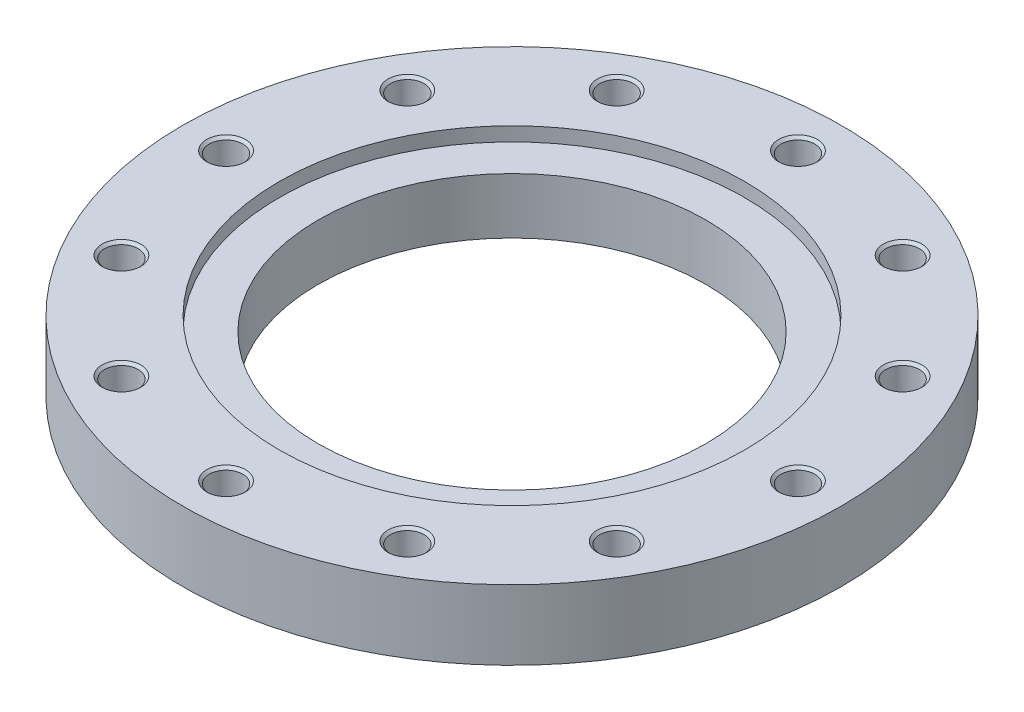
ISO-10303-21;
HEADER;
FILE_DESCRIPTION(('STEP AP214'),'2;1');
FILE_NAME('part.step','',(''),(''),'','','');
FILE_SCHEMA(('AUTOMOTIVE_DESIGN { 1 0 10303 214 1 1 1 1 }'));
ENDSEC;
DATA;
#1=APPLICATION_CONTEXT('core data for automotive mechanical design processes');
#2=APPLICATION_PROTOCOL_DEFINITION('international standard','automotive_design',2000,#1);
#3=PRODUCT_CONTEXT('',#1,'mechanical');
#4=PRODUCT('Part','Part','',(#3));
#5=PRODUCT_RELATED_PRODUCT_CATEGORY('part','',(#4));
#6=PRODUCT_DEFINITION_FORMATION('','',#4);
#7=PRODUCT_DEFINITION_CONTEXT('part definition',#1,'design');
#8=PRODUCT_DEFINITION('design','',#6,#7);
#9=PRODUCT_DEFINITION_SHAPE('','',#8);
#10=(LENGTH_UNIT() NAMED_UNIT(*) SI_UNIT(.MILLI.,.METRE.));
#11=(NAMED_UNIT(*) PLANE_ANGLE_UNIT() SI_UNIT($,.RADIAN.));
#12=(NAMED_UNIT(*) SI_UNIT($,.STERADIAN.) SOLID_ANGLE_UNIT());
#13=UNCERTAINTY_MEASURE_WITH_UNIT(LENGTH_MEASURE(1.E-05),#10,'distance_accuracy_value','');
#14=(GEOMETRIC_REPRESENTATION_CONTEXT(3) GLOBAL_UNCERTAINTY_ASSIGNED_CONTEXT((#13)) GLOBAL_UNIT_ASSIGNED_CONTEXT((#10,
#11,#12)) REPRESENTATION_CONTEXT('',''));
#15=CARTESIAN_POINT('',(0.,0.,0.));
#16=DIRECTION('',(0.,0.,1.));
#17=DIRECTION('',(1.,0.,0.));
#18=AXIS2_PLACEMENT_3D('',#15,#16,#17);
#19=CARTESIAN_POINT('',(0.,18.,0.));
#20=DIRECTION('',(0.,-1.,0.));
#21=DIRECTION('',(1.,0.,0.));
#22=AXIS2_PLACEMENT_3D('',#19,#20,#21);
#23=CYLINDRICAL_SURFACE('',#22,170.);
#24=CARTESIAN_POINT('',(0.,0.,0.));
#25=DIRECTION('',(0.,1.,0.));
#26=DIRECTION('',(1.,0.,0.));
#27=AXIS2_PLACEMENT_3D('',#24,#25,#26);
#28=CIRCLE('',#27,170.);
#29=CARTESIAN_POINT('',(170.,0.,0.));
#30=VERTEX_POINT('',#29);
#31=EDGE_CURVE('E9',#30,#30,#28,.T.);
#32=ORIENTED_EDGE('',*,*,#31,.T.);
#33=EDGE_LOOP('',(#32));
#34=FACE_BOUND('',#33,.T.);
#35=CARTESIAN_POINT('',(0.,36.,0.));
#36=DIRECTION('',(0.,1.,0.));
#37=DIRECTION('',(1.,0.,0.));
#38=AXIS2_PLACEMENT_3D('',#35,#36,#37);
#39=CIRCLE('',#38,170.);
#40=CARTESIAN_POINT('',(170.,36.,0.));
#41=VERTEX_POINT('',#40);
#42=EDGE_CURVE('E342',#41,#41,#39,.T.);
#43=ORIENTED_EDGE('',*,*,#42,.F.);
#44=EDGE_LOOP('',(#43));
#45=FACE_BOUND('',#44,.T.);
#46=ADVANCED_FACE('F15',(#34,#45),#23,.T.);
#47=CARTESIAN_POINT('',(135.,0.,0.));
#48=DIRECTION('',(0.,-1.,0.));
#49=DIRECTION('',(-1.,0.,0.));
#50=AXIS2_PLACEMENT_3D('',#47,#48,#49);
#51=PLANE('',#50);
#52=CARTESIAN_POINT('',(0.,0.,0.));
#53=DIRECTION('',(0.,1.,0.));
#54=DIRECTION('',(1.,0.,0.));
#55=AXIS2_PLACEMENT_3D('',#52,#53,#54);
#56=CIRCLE('',#55,100.);
#57=CARTESIAN_POINT('',(100.,0.,0.));
#58=VERTEX_POINT('',#57);
#59=EDGE_CURVE('E22',#58,#58,#56,.T.);
#60=ORIENTED_EDGE('',*,*,#59,.T.);
#61=EDGE_LOOP('',(#60));
#62=FACE_BOUND('',#61,.T.);
#63=ORIENTED_EDGE('',*,*,#31,.F.);
#64=EDGE_LOOP('',(#63));
#65=FACE_BOUND('',#64,.T.);
#66=ADVANCED_FACE('F444',(#62,#65),#51,.T.);
#67=CARTESIAN_POINT('',(0.,18.,0.));
#68=DIRECTION('',(0.,-1.,0.));
#69=DIRECTION('',(1.,0.,0.));
#70=AXIS2_PLACEMENT_3D('',#67,#68,#69);
#71=CYLINDRICAL_SURFACE('',#70,100.);
#72=ORIENTED_EDGE('',*,*,#59,.F.);
#73=EDGE_LOOP('',(#72));
#74=FACE_BOUND('',#73,.T.);
#75=CARTESIAN_POINT('',(0.,28.8,0.));
#76=DIRECTION('',(0.,1.,0.));
#77=DIRECTION('',(1.,0.,0.));
#78=AXIS2_PLACEMENT_3D('',#75,#76,#77);
#79=CIRCLE('',#78,100.);
#80=CARTESIAN_POINT('',(-100.,28.8,0.));
#81=VERTEX_POINT('',#80);
#82=EDGE_CURVE('E202',#81,#81,#79,.T.);
#83=ORIENTED_EDGE('',*,*,#82,.T.);
#84=EDGE_LOOP('',(#83));
#85=FACE_BOUND('',#84,.T.);
#86=ADVANCED_FACE('F448',(#74,#85),#71,.F.);
#87=CARTESIAN_POINT('',(135.,36.,0.));
#88=DIRECTION('',(0.,1.,0.));
#89=DIRECTION('',(1.,0.,0.));
#90=AXIS2_PLACEMENT_3D('',#87,#88,#89);
#91=PLANE('',#90);
#92=ORIENTED_EDGE('',*,*,#42,.T.);
#93=EDGE_LOOP('',(#92));
#94=FACE_BOUND('',#93,.T.);
#95=CARTESIAN_POINT('',(0.,36.,0.));
#96=DIRECTION('',(0.,-1.,0.));
#97=DIRECTION('',(1.,0.,0.));
#98=AXIS2_PLACEMENT_3D('',#95,#96,#97);
#99=CIRCLE('',#98,120.);
#100=CARTESIAN_POINT('',(-120.,36.,0.));
#101=VERTEX_POINT('',#100);
#102=EDGE_CURVE('E350',#101,#101,#99,.T.);
#103=ORIENTED_EDGE('',*,*,#102,.T.);
#104=EDGE_LOOP('',(#103));
#105=FACE_BOUND('',#104,.T.);
#106=CARTESIAN_POINT('',(147.5,36.,0.));
#107=DIRECTION('',(0.,-1.,0.));
#108=DIRECTION('',(1.,0.,0.));
#109=AXIS2_PLACEMENT_3D('',#106,#107,#108);
#110=CIRCLE('',#109,10.);
#111=CARTESIAN_POINT('',(157.5,36.,0.));
#112=VERTEX_POINT('',#111);
#113=EDGE_CURVE('E299',#112,#112,#110,.T.);
#114=ORIENTED_EDGE('',*,*,#113,.T.);
#115=EDGE_LOOP('',(#114));
#116=FACE_BOUND('',#115,.T.);
#117=CARTESIAN_POINT('',(127.738747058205,36.,-73.75));
#118=DIRECTION('',(0.,-1.,0.));
#119=DIRECTION('',(0.866025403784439,0.,-0.5));
#120=AXIS2_PLACEMENT_3D('',#117,#118,#119);
#121=CIRCLE('',#120,10.);
#122=CARTESIAN_POINT('',(136.399001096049,36.,-78.75));
#123=VERTEX_POINT('',#122);
#124=EDGE_CURVE('E366',#123,#123,#121,.T.);
#125=ORIENTED_EDGE('',*,*,#124,.T.);
#126=EDGE_LOOP('',(#125));
#127=FACE_BOUND('',#126,.T.);
#128=CARTESIAN_POINT('',(73.75,36.,-127.738747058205));
#129=DIRECTION('',(0.,-1.,0.));
#130=DIRECTION('',(0.5,0.,-0.866025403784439));
#131=AXIS2_PLACEMENT_3D('',#128,#129,#130);
#132=CIRCLE('',#131,10.);
#133=CARTESIAN_POINT('',(78.75,36.,-136.399001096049));
#134=VERTEX_POINT('',#133);
#135=EDGE_CURVE('E355',#134,#134,#132,.T.);
#136=ORIENTED_EDGE('',*,*,#135,.T.);
#137=EDGE_LOOP('',(#136));
#138=FACE_BOUND('',#137,.T.);
#139=CARTESIAN_POINT('',(0.,36.,-147.5));
#140=DIRECTION('',(0.,-1.,0.));
#141=DIRECTION('',(0.,0.,-1.));
#142=AXIS2_PLACEMENT_3D('',#139,#140,#141);
#143=CIRCLE('',#142,10.);
#144=CARTESIAN_POINT('',(0.,36.,-157.5));
#145=VERTEX_POINT('',#144);
#146=EDGE_CURVE('E338',#145,#145,#143,.T.);
#147=ORIENTED_EDGE('',*,*,#146,.T.);
#148=EDGE_LOOP('',(#147));
#149=FACE_BOUND('',#148,.T.);
#150=CARTESIAN_POINT('',(-73.75,36.,-127.738747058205));
#151=DIRECTION('',(0.,-1.,0.));
#152=DIRECTION('',(-0.5,0.,-0.866025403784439));
#153=AXIS2_PLACEMENT_3D('',#150,#151,#152);
#154=CIRCLE('',#153,10.);
#155=CARTESIAN_POINT('',(-78.75,36.,-136.399001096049));
#156=VERTEX_POINT('',#155);
#157=EDGE_CURVE('E292',#156,#156,#154,.T.);
#158=ORIENTED_EDGE('',*,*,#157,.T.);
#159=EDGE_LOOP('',(#158));
#160=FACE_BOUND('',#159,.T.);
#161=CARTESIAN_POINT('',(-127.738747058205,36.,-73.75));
#162=DIRECTION('',(0.,-1.,0.));
#163=DIRECTION('',(-0.866025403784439,0.,-0.5));
#164=AXIS2_PLACEMENT_3D('',#161,#162,#163);
#165=CIRCLE('',#164,10.);
#166=CARTESIAN_POINT('',(-136.399001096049,36.,-78.75));
#167=VERTEX_POINT('',#166);
#168=EDGE_CURVE('E318',#167,#167,#165,.T.);
#169=ORIENTED_EDGE('',*,*,#168,.T.);
#170=EDGE_LOOP('',(#169));
#171=FACE_BOUND('',#170,.T.);
#172=CARTESIAN_POINT('',(-147.5,36.,0.));
#173=DIRECTION('',(0.,-1.,0.));
#174=DIRECTION('',(-1.,0.,0.));
#175=AXIS2_PLACEMENT_3D('',#172,#173,#174);
#176=CIRCLE('',#175,10.);
#177=CARTESIAN_POINT('',(-157.5,36.,0.));
#178=VERTEX_POINT('',#177);
#179=EDGE_CURVE('E305',#178,#178,#176,.T.);
#180=ORIENTED_EDGE('',*,*,#179,.T.);
#181=EDGE_LOOP('',(#180));
#182=FACE_BOUND('',#181,.T.);
#183=CARTESIAN_POINT('',(-127.738747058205,36.,73.75));
#184=DIRECTION('',(0.,-1.,0.));
#185=DIRECTION('',(-0.866025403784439,0.,0.5));
#186=AXIS2_PLACEMENT_3D('',#183,#184,#185);
#187=CIRCLE('',#186,10.);
#188=CARTESIAN_POINT('',(-136.399001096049,36.,78.75));
#189=VERTEX_POINT('',#188);
#190=EDGE_CURVE('E279',#189,#189,#187,.T.);
#191=ORIENTED_EDGE('',*,*,#190,.T.);
#192=EDGE_LOOP('',(#191));
#193=FACE_BOUND('',#192,.T.);
#194=CARTESIAN_POINT('',(-73.75,36.,127.738747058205));
#195=DIRECTION('',(0.,-1.,0.));
#196=DIRECTION('',(-0.5,0.,0.866025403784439));
#197=AXIS2_PLACEMENT_3D('',#194,#195,#196);
#198=CIRCLE('',#197,10.);
#199=CARTESIAN_POINT('',(-78.75,36.,136.399001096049));
#200=VERTEX_POINT('',#199);
#201=EDGE_CURVE('E385',#200,#200,#198,.T.);
#202=ORIENTED_EDGE('',*,*,#201,.T.);
#203=EDGE_LOOP('',(#202));
#204=FACE_BOUND('',#203,.T.);
#205=CARTESIAN_POINT('',(0.,36.,147.5));
#206=DIRECTION('',(0.,-1.,0.));
#207=DIRECTION('',(0.,0.,1.));
#208=AXIS2_PLACEMENT_3D('',#205,#206,#207);
#209=CIRCLE('',#208,10.);
#210=CARTESIAN_POINT('',(0.,36.,157.5));
#211=VERTEX_POINT('',#210);
#212=EDGE_CURVE('E465',#211,#211,#209,.T.);
#213=ORIENTED_EDGE('',*,*,#212,.T.);
#214=EDGE_LOOP('',(#213));
#215=FACE_BOUND('',#214,.T.);
#216=CARTESIAN_POINT('',(73.75,36.,127.738747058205));
#217=DIRECTION('',(0.,-1.,0.));
#218=DIRECTION('',(0.5,0.,0.866025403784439));
#219=AXIS2_PLACEMENT_3D('',#216,#217,#218);
#220=CIRCLE('',#219,10.);
#221=CARTESIAN_POINT('',(78.75,36.,136.399001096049));
#222=VERTEX_POINT('',#221);
#223=EDGE_CURVE('E470',#222,#222,#220,.T.);
#224=ORIENTED_EDGE('',*,*,#223,.T.);
#225=EDGE_LOOP('',(#224));
#226=FACE_BOUND('',#225,.T.);
#227=CARTESIAN_POINT('',(127.738747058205,36.,73.75));
#228=DIRECTION('',(0.,-1.,0.));
#229=DIRECTION('',(0.866025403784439,0.,0.5));
#230=AXIS2_PLACEMENT_3D('',#227,#228,#229);
#231=CIRCLE('',#230,10.);
#232=CARTESIAN_POINT('',(136.399001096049,36.,78.75));
#233=VERTEX_POINT('',#232);
#234=EDGE_CURVE('E1272',#233,#233,#231,.T.);
#235=ORIENTED_EDGE('',*,*,#234,.T.);
#236=EDGE_LOOP('',(#235));
#237=FACE_BOUND('',#236,.T.);
#238=ADVANCED_FACE('F397',(#94,#105,#116,#127,#138,#149,#160,#171,#182,#193,#204,#215,#226,
#237),#91,.T.);
#239=CARTESIAN_POINT('',(0.,28.8,0.));
#240=DIRECTION('',(0.,-1.,0.));
#241=DIRECTION('',(-1.,0.,0.));
#242=AXIS2_PLACEMENT_3D('',#239,#240,#241);
#243=PLANE('',#242);
#244=CARTESIAN_POINT('',(0.,28.8,0.));
#245=DIRECTION('',(0.,-1.,0.));
#246=DIRECTION('',(1.,0.,0.));
#247=AXIS2_PLACEMENT_3D('',#244,#245,#246);
#248=CIRCLE('',#247,120.);
#249=CARTESIAN_POINT('',(120.,28.8,0.));
#250=VERTEX_POINT('',#249);
#251=EDGE_CURVE('E197',#250,#250,#248,.T.);
#252=ORIENTED_EDGE('',*,*,#251,.F.);
#253=EDGE_LOOP('',(#252));
#254=FACE_BOUND('',#253,.T.);
#255=ORIENTED_EDGE('',*,*,#82,.F.);
#256=EDGE_LOOP('',(#255));
#257=FACE_BOUND('',#256,.T.);
#258=ADVANCED_FACE('F512',(#254,#257),#243,.F.);
#259=CARTESIAN_POINT('',(0.,34.2,0.));
#260=DIRECTION('',(0.,-1.,0.));
#261=DIRECTION('',(1.,0.,0.));
#262=AXIS2_PLACEMENT_3D('',#259,#260,#261);
#263=CYLINDRICAL_SURFACE('',#262,120.);
#264=ORIENTED_EDGE('',*,*,#251,.T.);
#265=EDGE_LOOP('',(#264));
#266=FACE_BOUND('',#265,.T.);
#267=ORIENTED_EDGE('',*,*,#102,.F.);
#268=EDGE_LOOP('',(#267));
#269=FACE_BOUND('',#268,.T.);
#270=ADVANCED_FACE('F885',(#266,#269),#263,.F.);
#271=CARTESIAN_POINT('',(147.5,5.50386219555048,0.));
#272=DIRECTION('',(0.,1.,0.));
#273=DIRECTION('',(1.,0.,0.));
#274=AXIS2_PLACEMENT_3D('',#271,#272,#273);
#275=CONICAL_SURFACE('',#274,4.3234375,1.0471975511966);
#276=CARTESIAN_POINT('',(147.5,8.,0.));
#277=DIRECTION('',(0.,-1.,0.));
#278=DIRECTION('',(1.,0.,0.));
#279=AXIS2_PLACEMENT_3D('',#276,#277,#278);
#280=CIRCLE('',#279,8.646875);
#281=CARTESIAN_POINT('',(156.146875,8.,0.));
#282=VERTEX_POINT('',#281);
#283=EDGE_CURVE('E348',#282,#282,#280,.T.);
#284=ORIENTED_EDGE('',*,*,#283,.F.);
#285=EDGE_LOOP('',(#284));
#286=FACE_BOUND('',#285,.T.);
#287=CARTESIAN_POINT('',(147.5,3.00772439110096,0.));
#288=VERTEX_POINT('',#287);
#289=VERTEX_LOOP('',#288);
#290=FACE_BOUND('',#289,.T.);
#291=ADVANCED_FACE('F887',(#286,#290),#275,.F.);
#292=CARTESIAN_POINT('',(147.5,11.3234375,0.));
#293=DIRECTION('',(0.,1.,0.));
#294=DIRECTION('',(1.,0.,0.));
#295=AXIS2_PLACEMENT_3D('',#292,#293,#294);
#296=CYLINDRICAL_SURFACE('',#295,8.646875);
#297=CARTESIAN_POINT('',(147.5,14.646875,0.));
#298=DIRECTION('',(0.,-1.,0.));
#299=DIRECTION('',(1.,0.,0.));
#300=AXIS2_PLACEMENT_3D('',#297,#298,#299);
#301=CIRCLE('',#300,8.646875);
#302=CARTESIAN_POINT('',(156.146875,14.646875,0.));
#303=VERTEX_POINT('',#302);
#304=EDGE_CURVE('E351',#303,#303,#301,.T.);
#305=ORIENTED_EDGE('',*,*,#304,.F.);
#306=EDGE_LOOP('',(#305));
#307=FACE_BOUND('',#306,.T.);
#308=ORIENTED_EDGE('',*,*,#283,.T.);
#309=EDGE_LOOP('',(#308));
#310=FACE_BOUND('',#309,.T.);
#311=ADVANCED_FACE('F846',(#307,#310),#296,.F.);
#312=CARTESIAN_POINT('',(147.5,15.3234375,0.));
#313=DIRECTION('',(0.,1.,0.));
#314=DIRECTION('',(1.,0.,0.));
#315=AXIS2_PLACEMENT_3D('',#312,#313,#314);
#316=CONICAL_SURFACE('',#315,9.3234375,0.785398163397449);
#317=CARTESIAN_POINT('',(147.5,16.,0.));
#318=DIRECTION('',(0.,-1.,0.));
#319=DIRECTION('',(1.,0.,0.));
#320=AXIS2_PLACEMENT_3D('',#317,#318,#319);
#321=CIRCLE('',#320,10.);
#322=CARTESIAN_POINT('',(157.5,16.,0.));
#323=VERTEX_POINT('',#322);
#324=EDGE_CURVE('E284',#323,#323,#321,.T.);
#325=ORIENTED_EDGE('',*,*,#324,.F.);
#326=EDGE_LOOP('',(#325));
#327=FACE_BOUND('',#326,.T.);
#328=ORIENTED_EDGE('',*,*,#304,.T.);
#329=EDGE_LOOP('',(#328));
#330=FACE_BOUND('',#329,.T.);
#331=ADVANCED_FACE('F844',(#327,#330),#316,.F.);
#332=CARTESIAN_POINT('',(156.8234375,16.,0.));
#333=DIRECTION('',(0.,1.,0.));
#334=DIRECTION('',(-1.,0.,0.));
#335=AXIS2_PLACEMENT_3D('',#332,#333,#334);
#336=PLANE('',#335);
#337=CARTESIAN_POINT('',(147.5,16.,0.));
#338=DIRECTION('',(0.,-1.,0.));
#339=DIRECTION('',(1.,0.,0.));
#340=AXIS2_PLACEMENT_3D('',#337,#338,#339);
#341=CIRCLE('',#340,8.646875);
#342=CARTESIAN_POINT('',(156.146875,16.,0.));
#343=VERTEX_POINT('',#342);
#344=EDGE_CURVE('E302',#343,#343,#341,.T.);
#345=ORIENTED_EDGE('',*,*,#344,.F.);
#346=EDGE_LOOP('',(#345));
#347=FACE_BOUND('',#346,.T.);
#348=ORIENTED_EDGE('',*,*,#324,.T.);
#349=EDGE_LOOP('',(#348));
#350=FACE_BOUND('',#349,.T.);
#351=ADVANCED_FACE('F503',(#347,#350),#336,.F.);
#352=CARTESIAN_POINT('',(147.5,25.3234375,0.));
#353=DIRECTION('',(0.,1.,0.));
#354=DIRECTION('',(1.,0.,0.));
#355=AXIS2_PLACEMENT_3D('',#352,#353,#354);
#356=CYLINDRICAL_SURFACE('',#355,8.646875);
#357=CARTESIAN_POINT('',(147.5,34.646875,0.));
#358=DIRECTION('',(0.,-1.,0.));
#359=DIRECTION('',(1.,0.,0.));
#360=AXIS2_PLACEMENT_3D('',#357,#358,#359);
#361=CIRCLE('',#360,8.646875);
#362=CARTESIAN_POINT('',(156.146875,34.646875,0.));
#363=VERTEX_POINT('',#362);
#364=EDGE_CURVE('E303',#363,#363,#361,.T.);
#365=ORIENTED_EDGE('',*,*,#364,.F.);
#366=EDGE_LOOP('',(#365));
#367=FACE_BOUND('',#366,.T.);
#368=ORIENTED_EDGE('',*,*,#344,.T.);
#369=EDGE_LOOP('',(#368));
#370=FACE_BOUND('',#369,.T.);
#371=ADVANCED_FACE('F927',(#367,#370),#356,.F.);
#372=CARTESIAN_POINT('',(147.5,35.3234375,0.));
#373=DIRECTION('',(0.,1.,0.));
#374=DIRECTION('',(1.,0.,0.));
#375=AXIS2_PLACEMENT_3D('',#372,#373,#374);
#376=CONICAL_SURFACE('',#375,9.3234375,0.785398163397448);
#377=ORIENTED_EDGE('',*,*,#113,.F.);
#378=EDGE_LOOP('',(#377));
#379=FACE_BOUND('',#378,.T.);
#380=ORIENTED_EDGE('',*,*,#364,.T.);
#381=EDGE_LOOP('',(#380));
#382=FACE_BOUND('',#381,.T.);
#383=ADVANCED_FACE('F923',(#379,#382),#376,.F.);
#384=CARTESIAN_POINT('',(127.738747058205,5.50386219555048,-73.75));
#385=DIRECTION('',(0.,1.,0.));
#386=DIRECTION('',(0.866025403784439,0.,-0.5));
#387=AXIS2_PLACEMENT_3D('',#384,#385,#386);
#388=CONICAL_SURFACE('',#387,4.3234375,1.0471975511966);
#389=CARTESIAN_POINT('',(127.738747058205,8.,-73.75));
#390=DIRECTION('',(0.,-1.,0.));
#391=DIRECTION('',(0.866025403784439,0.,-0.5));
#392=AXIS2_PLACEMENT_3D('',#389,#390,#391);
#393=CIRCLE('',#392,8.646875);
#394=CARTESIAN_POINT('',(135.227160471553,8.,-78.0734375));
#395=VERTEX_POINT('',#394);
#396=EDGE_CURVE('E336',#395,#395,#393,.T.);
#397=ORIENTED_EDGE('',*,*,#396,.F.);
#398=EDGE_LOOP('',(#397));
#399=FACE_BOUND('',#398,.T.);
#400=CARTESIAN_POINT('',(127.738747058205,3.00772439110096,-73.75));
#401=VERTEX_POINT('',#400);
#402=VERTEX_LOOP('',#401);
#403=FACE_BOUND('',#402,.T.);
#404=ADVANCED_FACE('F919',(#399,#403),#388,.F.);
#405=CARTESIAN_POINT('',(127.738747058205,11.3234375,-73.75));
#406=DIRECTION('',(0.,1.,0.));
#407=DIRECTION('',(0.866025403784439,0.,-0.5));
#408=AXIS2_PLACEMENT_3D('',#405,#406,#407);
#409=CYLINDRICAL_SURFACE('',#408,8.646875);
#410=CARTESIAN_POINT('',(127.738747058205,14.646875,-73.75));
#411=DIRECTION('',(0.,-1.,0.));
#412=DIRECTION('',(0.866025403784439,0.,-0.5));
#413=AXIS2_PLACEMENT_3D('',#410,#411,#412);
#414=CIRCLE('',#413,8.646875);
#415=CARTESIAN_POINT('',(135.227160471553,14.646875,-78.0734375));
#416=VERTEX_POINT('',#415);
#417=EDGE_CURVE('E371',#416,#416,#414,.T.);
#418=ORIENTED_EDGE('',*,*,#417,.F.);
#419=EDGE_LOOP('',(#418));
#420=FACE_BOUND('',#419,.T.);
#421=ORIENTED_EDGE('',*,*,#396,.T.);
#422=EDGE_LOOP('',(#421));
#423=FACE_BOUND('',#422,.T.);
#424=ADVANCED_FACE('F915',(#420,#423),#409,.F.);
#425=CARTESIAN_POINT('',(127.738747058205,15.3234375,-73.75));
#426=DIRECTION('',(0.,1.,0.));
#427=DIRECTION('',(0.866025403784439,0.,-0.5));
#428=AXIS2_PLACEMENT_3D('',#425,#426,#427);
#429=CONICAL_SURFACE('',#428,9.3234375,0.785398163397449);
#430=CARTESIAN_POINT('',(127.738747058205,16.,-73.75));
#431=DIRECTION('',(0.,-1.,0.));
#432=DIRECTION('',(0.866025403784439,0.,-0.5));
#433=AXIS2_PLACEMENT_3D('',#430,#431,#432);
#434=CIRCLE('',#433,10.);
#435=CARTESIAN_POINT('',(136.399001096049,16.,-78.75));
#436=VERTEX_POINT('',#435);
#437=EDGE_CURVE('E370',#436,#436,#434,.T.);
#438=ORIENTED_EDGE('',*,*,#437,.F.);
#439=EDGE_LOOP('',(#438));
#440=FACE_BOUND('',#439,.T.);
#441=ORIENTED_EDGE('',*,*,#417,.T.);
#442=EDGE_LOOP('',(#441));
#443=FACE_BOUND('',#442,.T.);
#444=ADVANCED_FACE('F911',(#440,#443),#429,.F.);
#445=CARTESIAN_POINT('',(135.813080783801,16.,-78.41171875));
#446=DIRECTION('',(0.,1.,0.));
#447=DIRECTION('',(-0.866025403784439,0.,0.5));
#448=AXIS2_PLACEMENT_3D('',#445,#446,#447);
#449=PLANE('',#448);
#450=CARTESIAN_POINT('',(127.738747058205,16.,-73.75));
#451=DIRECTION('',(0.,-1.,0.));
#452=DIRECTION('',(0.866025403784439,0.,-0.5));
#453=AXIS2_PLACEMENT_3D('',#450,#451,#452);
#454=CIRCLE('',#453,8.646875);
#455=CARTESIAN_POINT('',(135.227160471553,16.,-78.0734375));
#456=VERTEX_POINT('',#455);
#457=EDGE_CURVE('E368',#456,#456,#454,.T.);
#458=ORIENTED_EDGE('',*,*,#457,.F.);
#459=EDGE_LOOP('',(#458));
#460=FACE_BOUND('',#459,.T.);
#461=ORIENTED_EDGE('',*,*,#437,.T.);
#462=EDGE_LOOP('',(#461));
#463=FACE_BOUND('',#462,.T.);
#464=ADVANCED_FACE('F532',(#460,#463),#449,.F.);
#465=CARTESIAN_POINT('',(127.738747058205,25.3234375,-73.75));
#466=DIRECTION('',(0.,1.,0.));
#467=DIRECTION('',(0.866025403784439,0.,-0.5));
#468=AXIS2_PLACEMENT_3D('',#465,#466,#467);
#469=CYLINDRICAL_SURFACE('',#468,8.646875);
#470=CARTESIAN_POINT('',(127.738747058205,34.646875,-73.75));
#471=DIRECTION('',(0.,-1.,0.));
#472=DIRECTION('',(0.866025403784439,0.,-0.5));
#473=AXIS2_PLACEMENT_3D('',#470,#471,#472);
#474=CIRCLE('',#473,8.646875);
#475=CARTESIAN_POINT('',(135.227160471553,34.646875,-78.0734375));
#476=VERTEX_POINT('',#475);
#477=EDGE_CURVE('E364',#476,#476,#474,.T.);
#478=ORIENTED_EDGE('',*,*,#477,.F.);
#479=EDGE_LOOP('',(#478));
#480=FACE_BOUND('',#479,.T.);
#481=ORIENTED_EDGE('',*,*,#457,.T.);
#482=EDGE_LOOP('',(#481));
#483=FACE_BOUND('',#482,.T.);
#484=ADVANCED_FACE('F528',(#480,#483),#469,.F.);
#485=CARTESIAN_POINT('',(127.738747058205,35.3234375,-73.75));
#486=DIRECTION('',(0.,1.,0.));
#487=DIRECTION('',(0.866025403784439,0.,-0.5));
#488=AXIS2_PLACEMENT_3D('',#485,#486,#487);
#489=CONICAL_SURFACE('',#488,9.3234375,0.785398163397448);
#490=ORIENTED_EDGE('',*,*,#124,.F.);
#491=EDGE_LOOP('',(#490));
#492=FACE_BOUND('',#491,.T.);
#493=ORIENTED_EDGE('',*,*,#477,.T.);
#494=EDGE_LOOP('',(#493));
#495=FACE_BOUND('',#494,.T.);
#496=ADVANCED_FACE('F531',(#492,#495),#489,.F.);
#497=CARTESIAN_POINT('',(73.75,5.50386219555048,-127.738747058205));
#498=DIRECTION('',(0.,1.,0.));
#499=DIRECTION('',(0.5,0.,-0.866025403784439));
#500=AXIS2_PLACEMENT_3D('',#497,#498,#499);
#501=CONICAL_SURFACE('',#500,4.3234375,1.0471975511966);
#502=CARTESIAN_POINT('',(73.75,8.,-127.738747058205));
#503=DIRECTION('',(0.,-1.,0.));
#504=DIRECTION('',(0.5,0.,-0.866025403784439));
#505=AXIS2_PLACEMENT_3D('',#502,#503,#504);
#506=CIRCLE('',#505,8.646875);
#507=CARTESIAN_POINT('',(78.0734375,8.,-135.227160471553));
#508=VERTEX_POINT('',#507);
#509=EDGE_CURVE('E362',#508,#508,#506,.T.);
#510=ORIENTED_EDGE('',*,*,#509,.F.);
#511=EDGE_LOOP('',(#510));
#512=FACE_BOUND('',#511,.T.);
#513=CARTESIAN_POINT('',(73.75,3.00772439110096,-127.738747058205));
#514=VERTEX_POINT('',#513);
#515=VERTEX_LOOP('',#514);
#516=FACE_BOUND('',#515,.T.);
#517=ADVANCED_FACE('F898',(#512,#516),#501,.F.);
#518=CARTESIAN_POINT('',(73.75,11.3234375,-127.738747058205));
#519=DIRECTION('',(0.,1.,0.));
#520=DIRECTION('',(0.5,0.,-0.866025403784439));
#521=AXIS2_PLACEMENT_3D('',#518,#519,#520);
#522=CYLINDRICAL_SURFACE('',#521,8.646875);
#523=CARTESIAN_POINT('',(73.75,14.646875,-127.738747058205));
#524=DIRECTION('',(0.,-1.,0.));
#525=DIRECTION('',(0.5,0.,-0.866025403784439));
#526=AXIS2_PLACEMENT_3D('',#523,#524,#525);
#527=CIRCLE('',#526,8.646875);
#528=CARTESIAN_POINT('',(78.0734375,14.646875,-135.227160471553));
#529=VERTEX_POINT('',#528);
#530=EDGE_CURVE('E358',#529,#529,#527,.T.);
#531=ORIENTED_EDGE('',*,*,#530,.F.);
#532=EDGE_LOOP('',(#531));
#533=FACE_BOUND('',#532,.T.);
#534=ORIENTED_EDGE('',*,*,#509,.T.);
#535=EDGE_LOOP('',(#534));
#536=FACE_BOUND('',#535,.T.);
#537=ADVANCED_FACE('F894',(#533,#536),#522,.F.);
#538=CARTESIAN_POINT('',(73.75,15.3234375,-127.738747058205));
#539=DIRECTION('',(0.,1.,0.));
#540=DIRECTION('',(0.5,0.,-0.866025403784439));
#541=AXIS2_PLACEMENT_3D('',#538,#539,#540);
#542=CONICAL_SURFACE('',#541,9.3234375,0.785398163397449);
#543=CARTESIAN_POINT('',(73.75,16.,-127.738747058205));
#544=DIRECTION('',(0.,-1.,0.));
#545=DIRECTION('',(0.5,0.,-0.866025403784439));
#546=AXIS2_PLACEMENT_3D('',#543,#544,#545);
#547=CIRCLE('',#546,10.);
#548=CARTESIAN_POINT('',(78.75,16.,-136.399001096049));
#549=VERTEX_POINT('',#548);
#550=EDGE_CURVE('E356',#549,#549,#547,.T.);
#551=ORIENTED_EDGE('',*,*,#550,.F.);
#552=EDGE_LOOP('',(#551));
#553=FACE_BOUND('',#552,.T.);
#554=ORIENTED_EDGE('',*,*,#530,.T.);
#555=EDGE_LOOP('',(#554));
#556=FACE_BOUND('',#555,.T.);
#557=ADVANCED_FACE('F841',(#553,#556),#542,.F.);
#558=CARTESIAN_POINT('',(78.41171875,16.,-135.813080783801));
#559=DIRECTION('',(0.,1.,0.));
#560=DIRECTION('',(-0.5,0.,0.866025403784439));
#561=AXIS2_PLACEMENT_3D('',#558,#559,#560);
#562=PLANE('',#561);
#563=CARTESIAN_POINT('',(73.75,16.,-127.738747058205));
#564=DIRECTION('',(0.,-1.,0.));
#565=DIRECTION('',(0.5,0.,-0.866025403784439));
#566=AXIS2_PLACEMENT_3D('',#563,#564,#565);
#567=CIRCLE('',#566,8.646875);
#568=CARTESIAN_POINT('',(78.0734375,16.,-135.227160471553));
#569=VERTEX_POINT('',#568);
#570=EDGE_CURVE('E359',#569,#569,#567,.T.);
#571=ORIENTED_EDGE('',*,*,#570,.F.);
#572=EDGE_LOOP('',(#571));
#573=FACE_BOUND('',#572,.T.);
#574=ORIENTED_EDGE('',*,*,#550,.T.);
#575=EDGE_LOOP('',(#574));
#576=FACE_BOUND('',#575,.T.);
#577=ADVANCED_FACE('F838',(#573,#576),#562,.F.);
#578=CARTESIAN_POINT('',(73.75,25.3234375,-127.738747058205));
#579=DIRECTION('',(0.,1.,0.));
#580=DIRECTION('',(0.5,0.,-0.866025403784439));
#581=AXIS2_PLACEMENT_3D('',#578,#579,#580);
#582=CYLINDRICAL_SURFACE('',#581,8.646875);
#583=CARTESIAN_POINT('',(73.75,34.646875,-127.738747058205));
#584=DIRECTION('',(0.,-1.,0.));
#585=DIRECTION('',(0.5,0.,-0.866025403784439));
#586=AXIS2_PLACEMENT_3D('',#583,#584,#585);
#587=CIRCLE('',#586,8.646875);
#588=CARTESIAN_POINT('',(78.0734375,34.646875,-135.227160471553));
#589=VERTEX_POINT('',#588);
#590=EDGE_CURVE('E353',#589,#589,#587,.T.);
#591=ORIENTED_EDGE('',*,*,#590,.F.);
#592=EDGE_LOOP('',(#591));
#593=FACE_BOUND('',#592,.T.);
#594=ORIENTED_EDGE('',*,*,#570,.T.);
#595=EDGE_LOOP('',(#594));
#596=FACE_BOUND('',#595,.T.);
#597=ADVANCED_FACE('F840',(#593,#596),#582,.F.);
#598=CARTESIAN_POINT('',(73.75,35.3234375,-127.738747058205));
#599=DIRECTION('',(0.,1.,0.));
#600=DIRECTION('',(0.5,0.,-0.866025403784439));
#601=AXIS2_PLACEMENT_3D('',#598,#599,#600);
#602=CONICAL_SURFACE('',#601,9.3234375,0.785398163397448);
#603=ORIENTED_EDGE('',*,*,#135,.F.);
#604=EDGE_LOOP('',(#603));
#605=FACE_BOUND('',#604,.T.);
#606=ORIENTED_EDGE('',*,*,#590,.T.);
#607=EDGE_LOOP('',(#606));
#608=FACE_BOUND('',#607,.T.);
#609=ADVANCED_FACE('F877',(#605,#608),#602,.F.);
#610=CARTESIAN_POINT('',(0.,5.50386219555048,-147.5));
#611=DIRECTION('',(0.,1.,0.));
#612=DIRECTION('',(0.,0.,-1.));
#613=AXIS2_PLACEMENT_3D('',#610,#611,#612);
#614=CONICAL_SURFACE('',#613,4.3234375,1.0471975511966);
#615=CARTESIAN_POINT('',(0.,8.,-147.5));
#616=DIRECTION('',(0.,-1.,0.));
#617=DIRECTION('',(0.,0.,-1.));
#618=AXIS2_PLACEMENT_3D('',#615,#616,#617);
#619=CIRCLE('',#618,8.646875);
#620=CARTESIAN_POINT('',(0.,8.,-156.146875));
#621=VERTEX_POINT('',#620);
#622=EDGE_CURVE('E347',#621,#621,#619,.T.);
#623=ORIENTED_EDGE('',*,*,#622,.F.);
#624=EDGE_LOOP('',(#623));
#625=FACE_BOUND('',#624,.T.);
#626=CARTESIAN_POINT('',(0.,3.00772439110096,-147.5));
#627=VERTEX_POINT('',#626);
#628=VERTEX_LOOP('',#627);
#629=FACE_BOUND('',#628,.T.);
#630=ADVANCED_FACE('F871',(#625,#629),#614,.F.);
#631=CARTESIAN_POINT('',(0.,11.3234375,-147.5));
#632=DIRECTION('',(0.,1.,0.));
#633=DIRECTION('',(0.,0.,-1.));
#634=AXIS2_PLACEMENT_3D('',#631,#632,#633);
#635=CYLINDRICAL_SURFACE('',#634,8.646875);
#636=CARTESIAN_POINT('',(0.,14.646875,-147.5));
#637=DIRECTION('',(0.,-1.,0.));
#638=DIRECTION('',(0.,0.,-1.));
#639=AXIS2_PLACEMENT_3D('',#636,#637,#638);
#640=CIRCLE('',#639,8.646875);
#641=CARTESIAN_POINT('',(0.,14.646875,-156.146875));
#642=VERTEX_POINT('',#641);
#643=EDGE_CURVE('E345',#642,#642,#640,.T.);
#644=ORIENTED_EDGE('',*,*,#643,.F.);
#645=EDGE_LOOP('',(#644));
#646=FACE_BOUND('',#645,.T.);
#647=ORIENTED_EDGE('',*,*,#622,.T.);
#648=EDGE_LOOP('',(#647));
#649=FACE_BOUND('',#648,.T.);
#650=ADVANCED_FACE('F861',(#646,#649),#635,.F.);
#651=CARTESIAN_POINT('',(0.,15.3234375,-147.5));
#652=DIRECTION('',(0.,1.,0.));
#653=DIRECTION('',(0.,0.,-1.));
#654=AXIS2_PLACEMENT_3D('',#651,#652,#653);
#655=CONICAL_SURFACE('',#654,9.3234375,0.785398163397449);
#656=CARTESIAN_POINT('',(0.,16.,-147.5));
#657=DIRECTION('',(0.,-1.,0.));
#658=DIRECTION('',(0.,0.,-1.));
#659=AXIS2_PLACEMENT_3D('',#656,#657,#658);
#660=CIRCLE('',#659,10.);
#661=CARTESIAN_POINT('',(0.,16.,-157.5));
#662=VERTEX_POINT('',#661);
#663=EDGE_CURVE('E344',#662,#662,#660,.T.);
#664=ORIENTED_EDGE('',*,*,#663,.F.);
#665=EDGE_LOOP('',(#664));
#666=FACE_BOUND('',#665,.T.);
#667=ORIENTED_EDGE('',*,*,#643,.T.);
#668=EDGE_LOOP('',(#667));
#669=FACE_BOUND('',#668,.T.);
#670=ADVANCED_FACE('F852',(#666,#669),#655,.F.);
#671=CARTESIAN_POINT('',(0.,16.,-156.8234375));
#672=DIRECTION('',(0.,1.,0.));
#673=DIRECTION('',(0.,0.,1.));
#674=AXIS2_PLACEMENT_3D('',#671,#672,#673);
#675=PLANE('',#674);
#676=CARTESIAN_POINT('',(0.,16.,-147.5));
#677=DIRECTION('',(0.,-1.,0.));
#678=DIRECTION('',(0.,0.,-1.));
#679=AXIS2_PLACEMENT_3D('',#676,#677,#678);
#680=CIRCLE('',#679,8.646875);
#681=CARTESIAN_POINT('',(0.,16.,-156.146875));
#682=VERTEX_POINT('',#681);
#683=EDGE_CURVE('E340',#682,#682,#680,.T.);
#684=ORIENTED_EDGE('',*,*,#683,.F.);
#685=EDGE_LOOP('',(#684));
#686=FACE_BOUND('',#685,.T.);
#687=ORIENTED_EDGE('',*,*,#663,.T.);
#688=EDGE_LOOP('',(#687));
#689=FACE_BOUND('',#688,.T.);
#690=ADVANCED_FACE('F849',(#686,#689),#675,.F.);
#691=CARTESIAN_POINT('',(0.,25.3234375,-147.5));
#692=DIRECTION('',(0.,1.,0.));
#693=DIRECTION('',(0.,0.,-1.));
#694=AXIS2_PLACEMENT_3D('',#691,#692,#693);
#695=CYLINDRICAL_SURFACE('',#694,8.646875);
#696=CARTESIAN_POINT('',(0.,34.646875,-147.5));
#697=DIRECTION('',(0.,-1.,0.));
#698=DIRECTION('',(0.,0.,-1.));
#699=AXIS2_PLACEMENT_3D('',#696,#697,#698);
#700=CIRCLE('',#699,8.646875);
#701=CARTESIAN_POINT('',(0.,34.646875,-156.146875));
#702=VERTEX_POINT('',#701);
#703=EDGE_CURVE('E334',#702,#702,#700,.T.);
#704=ORIENTED_EDGE('',*,*,#703,.F.);
#705=EDGE_LOOP('',(#704));
#706=FACE_BOUND('',#705,.T.);
#707=ORIENTED_EDGE('',*,*,#683,.T.);
#708=EDGE_LOOP('',(#707));
#709=FACE_BOUND('',#708,.T.);
#710=ADVANCED_FACE('F851',(#706,#709),#695,.F.);
#711=CARTESIAN_POINT('',(0.,35.3234375,-147.5));
#712=DIRECTION('',(0.,1.,0.));
#713=DIRECTION('',(0.,0.,-1.));
#714=AXIS2_PLACEMENT_3D('',#711,#712,#713);
#715=CONICAL_SURFACE('',#714,9.3234375,0.785398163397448);
#716=ORIENTED_EDGE('',*,*,#146,.F.);
#717=EDGE_LOOP('',(#716));
#718=FACE_BOUND('',#717,.T.);
#719=ORIENTED_EDGE('',*,*,#703,.T.);
#720=EDGE_LOOP('',(#719));
#721=FACE_BOUND('',#720,.T.);
#722=ADVANCED_FACE('F858',(#718,#721),#715,.F.);
#723=CARTESIAN_POINT('',(-73.75,5.50386219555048,-127.738747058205));
#724=DIRECTION('',(0.,1.,0.));
#725=DIRECTION('',(-0.5,0.,-0.866025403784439));
#726=AXIS2_PLACEMENT_3D('',#723,#724,#725);
#727=CONICAL_SURFACE('',#726,4.3234375,1.0471975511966);
#728=CARTESIAN_POINT('',(-73.75,8.,-127.738747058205));
#729=DIRECTION('',(0.,-1.,0.));
#730=DIRECTION('',(-0.5,0.,-0.866025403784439));
#731=AXIS2_PLACEMENT_3D('',#728,#729,#730);
#732=CIRCLE('',#731,8.646875);
#733=CARTESIAN_POINT('',(-78.0734375,8.,-135.227160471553));
#734=VERTEX_POINT('',#733);
#735=EDGE_CURVE('E332',#734,#734,#732,.T.);
#736=ORIENTED_EDGE('',*,*,#735,.F.);
#737=EDGE_LOOP('',(#736));
#738=FACE_BOUND('',#737,.T.);
#739=CARTESIAN_POINT('',(-73.75,3.00772439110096,-127.738747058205));
#740=VERTEX_POINT('',#739);
#741=VERTEX_LOOP('',#740);
#742=FACE_BOUND('',#741,.T.);
#743=ADVANCED_FACE('F1048',(#738,#742),#727,.F.);
#744=CARTESIAN_POINT('',(-73.75,11.3234375,-127.738747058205));
#745=DIRECTION('',(0.,1.,0.));
#746=DIRECTION('',(-0.5,0.,-0.866025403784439));
#747=AXIS2_PLACEMENT_3D('',#744,#745,#746);
#748=CYLINDRICAL_SURFACE('',#747,8.646875);
#749=CARTESIAN_POINT('',(-73.75,14.646875,-127.738747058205));
#750=DIRECTION('',(0.,-1.,0.));
#751=DIRECTION('',(-0.5,0.,-0.866025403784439));
#752=AXIS2_PLACEMENT_3D('',#749,#750,#751);
#753=CIRCLE('',#752,8.646875);
#754=CARTESIAN_POINT('',(-78.0734375,14.646875,-135.227160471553));
#755=VERTEX_POINT('',#754);
#756=EDGE_CURVE('E330',#755,#755,#753,.T.);
#757=ORIENTED_EDGE('',*,*,#756,.F.);
#758=EDGE_LOOP('',(#757));
#759=FACE_BOUND('',#758,.T.);
#760=ORIENTED_EDGE('',*,*,#735,.T.);
#761=EDGE_LOOP('',(#760));
#762=FACE_BOUND('',#761,.T.);
#763=ADVANCED_FACE('F1058',(#759,#762),#748,.F.);
#764=CARTESIAN_POINT('',(-73.75,15.3234375,-127.738747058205));
#765=DIRECTION('',(0.,1.,0.));
#766=DIRECTION('',(-0.5,0.,-0.866025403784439));
#767=AXIS2_PLACEMENT_3D('',#764,#765,#766);
#768=CONICAL_SURFACE('',#767,9.3234375,0.785398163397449);
#769=CARTESIAN_POINT('',(-73.75,16.,-127.738747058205));
#770=DIRECTION('',(0.,-1.,0.));
#771=DIRECTION('',(-0.5,0.,-0.866025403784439));
#772=AXIS2_PLACEMENT_3D('',#769,#770,#771);
#773=CIRCLE('',#772,10.);
#774=CARTESIAN_POINT('',(-78.75,16.,-136.399001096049));
#775=VERTEX_POINT('',#774);
#776=EDGE_CURVE('E329',#775,#775,#773,.T.);
#777=ORIENTED_EDGE('',*,*,#776,.F.);
#778=EDGE_LOOP('',(#777));
#779=FACE_BOUND('',#778,.T.);
#780=ORIENTED_EDGE('',*,*,#756,.T.);
#781=EDGE_LOOP('',(#780));
#782=FACE_BOUND('',#781,.T.);
#783=ADVANCED_FACE('F1068',(#779,#782),#768,.F.);
#784=CARTESIAN_POINT('',(-78.41171875,16.,-135.813080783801));
#785=DIRECTION('',(0.,1.,0.));
#786=DIRECTION('',(0.5,0.,0.866025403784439));
#787=AXIS2_PLACEMENT_3D('',#784,#785,#786);
#788=PLANE('',#787);
#789=CARTESIAN_POINT('',(-73.75,16.,-127.738747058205));
#790=DIRECTION('',(0.,-1.,0.));
#791=DIRECTION('',(-0.5,0.,-0.866025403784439));
#792=AXIS2_PLACEMENT_3D('',#789,#790,#791);
#793=CIRCLE('',#792,8.646875);
#794=CARTESIAN_POINT('',(-78.0734375,16.,-135.227160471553));
#795=VERTEX_POINT('',#794);
#796=EDGE_CURVE('E327',#795,#795,#793,.T.);
#797=ORIENTED_EDGE('',*,*,#796,.F.);
#798=EDGE_LOOP('',(#797));
#799=FACE_BOUND('',#798,.T.);
#800=ORIENTED_EDGE('',*,*,#776,.T.);
#801=EDGE_LOOP('',(#800));
#802=FACE_BOUND('',#801,.T.);
#803=ADVANCED_FACE('F1078',(#799,#802),#788,.F.);
#804=CARTESIAN_POINT('',(-73.75,25.3234375,-127.738747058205));
#805=DIRECTION('',(0.,1.,0.));
#806=DIRECTION('',(-0.5,0.,-0.866025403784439));
#807=AXIS2_PLACEMENT_3D('',#804,#805,#806);
#808=CYLINDRICAL_SURFACE('',#807,8.646875);
#809=CARTESIAN_POINT('',(-73.75,34.646875,-127.738747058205));
#810=DIRECTION('',(0.,-1.,0.));
#811=DIRECTION('',(-0.5,0.,-0.866025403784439));
#812=AXIS2_PLACEMENT_3D('',#809,#810,#811);
#813=CIRCLE('',#812,8.646875);
#814=CARTESIAN_POINT('',(-78.0734375,34.646875,-135.227160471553));
#815=VERTEX_POINT('',#814);
#816=EDGE_CURVE('E290',#815,#815,#813,.T.);
#817=ORIENTED_EDGE('',*,*,#816,.F.);
#818=EDGE_LOOP('',(#817));
#819=FACE_BOUND('',#818,.T.);
#820=ORIENTED_EDGE('',*,*,#796,.T.);
#821=EDGE_LOOP('',(#820));
#822=FACE_BOUND('',#821,.T.);
#823=ADVANCED_FACE('F440',(#819,#822),#808,.F.);
#824=CARTESIAN_POINT('',(-73.75,35.3234375,-127.738747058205));
#825=DIRECTION('',(0.,1.,0.));
#826=DIRECTION('',(-0.5,0.,-0.866025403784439));
#827=AXIS2_PLACEMENT_3D('',#824,#825,#826);
#828=CONICAL_SURFACE('',#827,9.3234375,0.785398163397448);
#829=ORIENTED_EDGE('',*,*,#157,.F.);
#830=EDGE_LOOP('',(#829));
#831=FACE_BOUND('',#830,.T.);
#832=ORIENTED_EDGE('',*,*,#816,.T.);
#833=EDGE_LOOP('',(#832));
#834=FACE_BOUND('',#833,.T.);
#835=ADVANCED_FACE('F434',(#831,#834),#828,.F.);
#836=CARTESIAN_POINT('',(-127.738747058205,5.50386219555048,-73.75));
#837=DIRECTION('',(0.,1.,0.));
#838=DIRECTION('',(-0.866025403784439,0.,-0.5));
#839=AXIS2_PLACEMENT_3D('',#836,#837,#838);
#840=CONICAL_SURFACE('',#839,4.3234375,1.0471975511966);
#841=CARTESIAN_POINT('',(-127.738747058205,8.,-73.75));
#842=DIRECTION('',(0.,-1.,0.));
#843=DIRECTION('',(-0.866025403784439,0.,-0.5));
#844=AXIS2_PLACEMENT_3D('',#841,#842,#843);
#845=CIRCLE('',#844,8.646875);
#846=CARTESIAN_POINT('',(-135.227160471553,8.,-78.0734375));
#847=VERTEX_POINT('',#846);
#848=EDGE_CURVE('E293',#847,#847,#845,.T.);
#849=ORIENTED_EDGE('',*,*,#848,.F.);
#850=EDGE_LOOP('',(#849));
#851=FACE_BOUND('',#850,.T.);
#852=CARTESIAN_POINT('',(-127.738747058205,3.00772439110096,-73.75));
#853=VERTEX_POINT('',#852);
#854=VERTEX_LOOP('',#853);
#855=FACE_BOUND('',#854,.T.);
#856=ADVANCED_FACE('F428',(#851,#855),#840,.F.);
#857=CARTESIAN_POINT('',(-127.738747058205,11.3234375,-73.75));
#858=DIRECTION('',(0.,1.,0.));
#859=DIRECTION('',(-0.866025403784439,0.,-0.5));
#860=AXIS2_PLACEMENT_3D('',#857,#858,#859);
#861=CYLINDRICAL_SURFACE('',#860,8.646875);
#862=CARTESIAN_POINT('',(-127.738747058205,14.646875,-73.75));
#863=DIRECTION('',(0.,-1.,0.));
#864=DIRECTION('',(-0.866025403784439,0.,-0.5));
#865=AXIS2_PLACEMENT_3D('',#862,#863,#864);
#866=CIRCLE('',#865,8.646875);
#867=CARTESIAN_POINT('',(-135.227160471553,14.646875,-78.0734375));
#868=VERTEX_POINT('',#867);
#869=EDGE_CURVE('E324',#868,#868,#866,.T.);
#870=ORIENTED_EDGE('',*,*,#869,.F.);
#871=EDGE_LOOP('',(#870));
#872=FACE_BOUND('',#871,.T.);
#873=ORIENTED_EDGE('',*,*,#848,.T.);
#874=EDGE_LOOP('',(#873));
#875=FACE_BOUND('',#874,.T.);
#876=ADVANCED_FACE('F422',(#872,#875),#861,.F.);
#877=CARTESIAN_POINT('',(-127.738747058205,15.3234375,-73.75));
#878=DIRECTION('',(0.,1.,0.));
#879=DIRECTION('',(-0.866025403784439,0.,-0.5));
#880=AXIS2_PLACEMENT_3D('',#877,#878,#879);
#881=CONICAL_SURFACE('',#880,9.3234375,0.785398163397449);
#882=CARTESIAN_POINT('',(-127.738747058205,16.,-73.75));
#883=DIRECTION('',(0.,-1.,0.));
#884=DIRECTION('',(-0.866025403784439,0.,-0.5));
#885=AXIS2_PLACEMENT_3D('',#882,#883,#884);
#886=CIRCLE('',#885,10.);
#887=CARTESIAN_POINT('',(-136.399001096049,16.,-78.75));
#888=VERTEX_POINT('',#887);
#889=EDGE_CURVE('E322',#888,#888,#886,.T.);
#890=ORIENTED_EDGE('',*,*,#889,.F.);
#891=EDGE_LOOP('',(#890));
#892=FACE_BOUND('',#891,.T.);
#893=ORIENTED_EDGE('',*,*,#869,.T.);
#894=EDGE_LOOP('',(#893));
#895=FACE_BOUND('',#894,.T.);
#896=ADVANCED_FACE('F416',(#892,#895),#881,.F.);
#897=CARTESIAN_POINT('',(-135.813080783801,16.,-78.41171875));
#898=DIRECTION('',(0.,1.,0.));
#899=DIRECTION('',(0.866025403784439,0.,0.5));
#900=AXIS2_PLACEMENT_3D('',#897,#898,#899);
#901=PLANE('',#900);
#902=CARTESIAN_POINT('',(-127.738747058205,16.,-73.75));
#903=DIRECTION('',(0.,-1.,0.));
#904=DIRECTION('',(-0.866025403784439,0.,-0.5));
#905=AXIS2_PLACEMENT_3D('',#902,#903,#904);
#906=CIRCLE('',#905,8.646875);
#907=CARTESIAN_POINT('',(-135.227160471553,16.,-78.0734375));
#908=VERTEX_POINT('',#907);
#909=EDGE_CURVE('E319',#908,#908,#906,.T.);
#910=ORIENTED_EDGE('',*,*,#909,.F.);
#911=EDGE_LOOP('',(#910));
#912=FACE_BOUND('',#911,.T.);
#913=ORIENTED_EDGE('',*,*,#889,.T.);
#914=EDGE_LOOP('',(#913));
#915=FACE_BOUND('',#914,.T.);
#916=ADVANCED_FACE('F410',(#912,#915),#901,.F.);
#917=CARTESIAN_POINT('',(-127.738747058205,25.3234375,-73.75));
#918=DIRECTION('',(0.,1.,0.));
#919=DIRECTION('',(-0.866025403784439,0.,-0.5));
#920=AXIS2_PLACEMENT_3D('',#917,#918,#919);
#921=CYLINDRICAL_SURFACE('',#920,8.646875);
#922=CARTESIAN_POINT('',(-127.738747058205,34.646875,-73.75));
#923=DIRECTION('',(0.,-1.,0.));
#924=DIRECTION('',(-0.866025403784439,0.,-0.5));
#925=AXIS2_PLACEMENT_3D('',#922,#923,#924);
#926=CIRCLE('',#925,8.646875);
#927=CARTESIAN_POINT('',(-135.227160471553,34.646875,-78.0734375));
#928=VERTEX_POINT('',#927);
#929=EDGE_CURVE('E316',#928,#928,#926,.T.);
#930=ORIENTED_EDGE('',*,*,#929,.F.);
#931=EDGE_LOOP('',(#930));
#932=FACE_BOUND('',#931,.T.);
#933=ORIENTED_EDGE('',*,*,#909,.T.);
#934=EDGE_LOOP('',(#933));
#935=FACE_BOUND('',#934,.T.);
#936=ADVANCED_FACE('F404',(#932,#935),#921,.F.);
#937=CARTESIAN_POINT('',(-127.738747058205,35.3234375,-73.75));
#938=DIRECTION('',(0.,1.,0.));
#939=DIRECTION('',(-0.866025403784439,0.,-0.5));
#940=AXIS2_PLACEMENT_3D('',#937,#938,#939);
#941=CONICAL_SURFACE('',#940,9.3234375,0.785398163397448);
#942=ORIENTED_EDGE('',*,*,#168,.F.);
#943=EDGE_LOOP('',(#942));
#944=FACE_BOUND('',#943,.T.);
#945=ORIENTED_EDGE('',*,*,#929,.T.);
#946=EDGE_LOOP('',(#945));
#947=FACE_BOUND('',#946,.T.);
#948=ADVANCED_FACE('F400',(#944,#947),#941,.F.);
#949=CARTESIAN_POINT('',(-147.5,5.50386219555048,0.));
#950=DIRECTION('',(0.,1.,0.));
#951=DIRECTION('',(-1.,0.,0.));
#952=AXIS2_PLACEMENT_3D('',#949,#950,#951);
#953=CONICAL_SURFACE('',#952,4.3234375,1.0471975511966);
#954=CARTESIAN_POINT('',(-147.5,8.,0.));
#955=DIRECTION('',(0.,-1.,0.));
#956=DIRECTION('',(-1.,0.,0.));
#957=AXIS2_PLACEMENT_3D('',#954,#955,#956);
#958=CIRCLE('',#957,8.646875);
#959=CARTESIAN_POINT('',(-156.146875,8.,0.));
#960=VERTEX_POINT('',#959);
#961=EDGE_CURVE('E314',#960,#960,#958,.T.);
#962=ORIENTED_EDGE('',*,*,#961,.F.);
#963=EDGE_LOOP('',(#962));
#964=FACE_BOUND('',#963,.T.);
#965=CARTESIAN_POINT('',(-147.5,3.00772439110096,0.));
#966=VERTEX_POINT('',#965);
#967=VERTEX_LOOP('',#966);
#968=FACE_BOUND('',#967,.T.);
#969=ADVANCED_FACE('F403',(#964,#968),#953,.F.);
#970=CARTESIAN_POINT('',(-147.5,11.3234375,0.));
#971=DIRECTION('',(0.,1.,0.));
#972=DIRECTION('',(-1.,0.,0.));
#973=AXIS2_PLACEMENT_3D('',#970,#971,#972);
#974=CYLINDRICAL_SURFACE('',#973,8.646875);
#975=CARTESIAN_POINT('',(-147.5,14.646875,0.));
#976=DIRECTION('',(0.,-1.,0.));
#977=DIRECTION('',(-1.,0.,0.));
#978=AXIS2_PLACEMENT_3D('',#975,#976,#977);
#979=CIRCLE('',#978,8.646875);
#980=CARTESIAN_POINT('',(-156.146875,14.646875,0.));
#981=VERTEX_POINT('',#980);
#982=EDGE_CURVE('E312',#981,#981,#979,.T.);
#983=ORIENTED_EDGE('',*,*,#982,.F.);
#984=EDGE_LOOP('',(#983));
#985=FACE_BOUND('',#984,.T.);
#986=ORIENTED_EDGE('',*,*,#961,.T.);
#987=EDGE_LOOP('',(#986));
#988=FACE_BOUND('',#987,.T.);
#989=ADVANCED_FACE('F507',(#985,#988),#974,.F.);
#990=CARTESIAN_POINT('',(-147.5,15.3234375,0.));
#991=DIRECTION('',(0.,1.,0.));
#992=DIRECTION('',(-1.,0.,0.));
#993=AXIS2_PLACEMENT_3D('',#990,#991,#992);
#994=CONICAL_SURFACE('',#993,9.3234375,0.785398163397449);
#995=CARTESIAN_POINT('',(-147.5,16.,0.));
#996=DIRECTION('',(0.,-1.,0.));
#997=DIRECTION('',(-1.,0.,0.));
#998=AXIS2_PLACEMENT_3D('',#995,#996,#997);
#999=CIRCLE('',#998,10.);
#1000=CARTESIAN_POINT('',(-157.5,16.,0.));
#1001=VERTEX_POINT('',#1000);
#1002=EDGE_CURVE('E310',#1001,#1001,#999,.T.);
#1003=ORIENTED_EDGE('',*,*,#1002,.F.);
#1004=EDGE_LOOP('',(#1003));
#1005=FACE_BOUND('',#1004,.T.);
#1006=ORIENTED_EDGE('',*,*,#982,.T.);
#1007=EDGE_LOOP('',(#1006));
#1008=FACE_BOUND('',#1007,.T.);
#1009=ADVANCED_FACE('F504',(#1005,#1008),#994,.F.);
#1010=CARTESIAN_POINT('',(-156.8234375,16.,0.));
#1011=DIRECTION('',(0.,1.,0.));
#1012=DIRECTION('',(1.,0.,0.));
#1013=AXIS2_PLACEMENT_3D('',#1010,#1011,#1012);
#1014=PLANE('',#1013);
#1015=CARTESIAN_POINT('',(-147.5,16.,0.));
#1016=DIRECTION('',(0.,-1.,0.));
#1017=DIRECTION('',(-1.,0.,0.));
#1018=AXIS2_PLACEMENT_3D('',#1015,#1016,#1017);
#1019=CIRCLE('',#1018,8.646875);
#1020=CARTESIAN_POINT('',(-156.146875,16.,0.));
#1021=VERTEX_POINT('',#1020);
#1022=EDGE_CURVE('E308',#1021,#1021,#1019,.T.);
#1023=ORIENTED_EDGE('',*,*,#1022,.F.);
#1024=EDGE_LOOP('',(#1023));
#1025=FACE_BOUND('',#1024,.T.);
#1026=ORIENTED_EDGE('',*,*,#1002,.T.);
#1027=EDGE_LOOP('',(#1026));
#1028=FACE_BOUND('',#1027,.T.);
#1029=ADVANCED_FACE('F506',(#1025,#1028),#1014,.F.);
#1030=CARTESIAN_POINT('',(-147.5,25.3234375,0.));
#1031=DIRECTION('',(0.,1.,0.));
#1032=DIRECTION('',(-1.,0.,0.));
#1033=AXIS2_PLACEMENT_3D('',#1030,#1031,#1032);
#1034=CYLINDRICAL_SURFACE('',#1033,8.646875);
#1035=CARTESIAN_POINT('',(-147.5,34.646875,0.));
#1036=DIRECTION('',(0.,-1.,0.));
#1037=DIRECTION('',(-1.,0.,0.));
#1038=AXIS2_PLACEMENT_3D('',#1035,#1036,#1037);
#1039=CIRCLE('',#1038,8.646875);
#1040=CARTESIAN_POINT('',(-156.146875,34.646875,0.));
#1041=VERTEX_POINT('',#1040);
#1042=EDGE_CURVE('E298',#1041,#1041,#1039,.T.);
#1043=ORIENTED_EDGE('',*,*,#1042,.F.);
#1044=EDGE_LOOP('',(#1043));
#1045=FACE_BOUND('',#1044,.T.);
#1046=ORIENTED_EDGE('',*,*,#1022,.T.);
#1047=EDGE_LOOP('',(#1046));
#1048=FACE_BOUND('',#1047,.T.);
#1049=ADVANCED_FACE('F564',(#1045,#1048),#1034,.F.);
#1050=CARTESIAN_POINT('',(-147.5,35.3234375,0.));
#1051=DIRECTION('',(0.,1.,0.));
#1052=DIRECTION('',(-1.,0.,0.));
#1053=AXIS2_PLACEMENT_3D('',#1050,#1051,#1052);
#1054=CONICAL_SURFACE('',#1053,9.3234375,0.785398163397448);
#1055=ORIENTED_EDGE('',*,*,#179,.F.);
#1056=EDGE_LOOP('',(#1055));
#1057=FACE_BOUND('',#1056,.T.);
#1058=ORIENTED_EDGE('',*,*,#1042,.T.);
#1059=EDGE_LOOP('',(#1058));
#1060=FACE_BOUND('',#1059,.T.);
#1061=ADVANCED_FACE('F559',(#1057,#1060),#1054,.F.);
#1062=CARTESIAN_POINT('',(-127.738747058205,5.50386219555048,73.75));
#1063=DIRECTION('',(0.,1.,0.));
#1064=DIRECTION('',(-0.866025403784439,0.,0.5));
#1065=AXIS2_PLACEMENT_3D('',#1062,#1063,#1064);
#1066=CONICAL_SURFACE('',#1065,4.3234375,1.0471975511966);
#1067=CARTESIAN_POINT('',(-127.738747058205,8.,73.75));
#1068=DIRECTION('',(0.,-1.,0.));
#1069=DIRECTION('',(-0.866025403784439,0.,0.5));
#1070=AXIS2_PLACEMENT_3D('',#1067,#1068,#1069);
#1071=CIRCLE('',#1070,8.646875);
#1072=CARTESIAN_POINT('',(-135.227160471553,8.,78.0734374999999));
#1073=VERTEX_POINT('',#1072);
#1074=EDGE_CURVE('E296',#1073,#1073,#1071,.T.);
#1075=ORIENTED_EDGE('',*,*,#1074,.F.);
#1076=EDGE_LOOP('',(#1075));
#1077=FACE_BOUND('',#1076,.T.);
#1078=CARTESIAN_POINT('',(-127.738747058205,3.00772439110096,73.75));
#1079=VERTEX_POINT('',#1078);
#1080=VERTEX_LOOP('',#1079);
#1081=FACE_BOUND('',#1080,.T.);
#1082=ADVANCED_FACE('F555',(#1077,#1081),#1066,.F.);
#1083=CARTESIAN_POINT('',(-127.738747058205,11.3234375,73.75));
#1084=DIRECTION('',(0.,1.,0.));
#1085=DIRECTION('',(-0.866025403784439,0.,0.5));
#1086=AXIS2_PLACEMENT_3D('',#1083,#1084,#1085);
#1087=CYLINDRICAL_SURFACE('',#1086,8.646875);
#1088=CARTESIAN_POINT('',(-127.738747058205,14.646875,73.75));
#1089=DIRECTION('',(0.,-1.,0.));
#1090=DIRECTION('',(-0.866025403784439,0.,0.5));
#1091=AXIS2_PLACEMENT_3D('',#1088,#1089,#1090);
#1092=CIRCLE('',#1091,8.646875);
#1093=CARTESIAN_POINT('',(-135.227160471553,14.646875,78.0734374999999));
#1094=VERTEX_POINT('',#1093);
#1095=EDGE_CURVE('E295',#1094,#1094,#1092,.T.);
#1096=ORIENTED_EDGE('',*,*,#1095,.F.);
#1097=EDGE_LOOP('',(#1096));
#1098=FACE_BOUND('',#1097,.T.);
#1099=ORIENTED_EDGE('',*,*,#1074,.T.);
#1100=EDGE_LOOP('',(#1099));
#1101=FACE_BOUND('',#1100,.T.);
#1102=ADVANCED_FACE('F551',(#1098,#1101),#1087,.F.);
#1103=CARTESIAN_POINT('',(-127.738747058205,15.3234375,73.75));
#1104=DIRECTION('',(0.,1.,0.));
#1105=DIRECTION('',(-0.866025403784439,0.,0.5));
#1106=AXIS2_PLACEMENT_3D('',#1103,#1104,#1105);
#1107=CONICAL_SURFACE('',#1106,9.3234375,0.785398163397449);
#1108=CARTESIAN_POINT('',(-127.738747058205,16.,73.75));
#1109=DIRECTION('',(0.,-1.,0.));
#1110=DIRECTION('',(-0.866025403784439,0.,0.5));
#1111=AXIS2_PLACEMENT_3D('',#1108,#1109,#1110);
#1112=CIRCLE('',#1111,10.);
#1113=CARTESIAN_POINT('',(-136.399001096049,16.,78.75));
#1114=VERTEX_POINT('',#1113);
#1115=EDGE_CURVE('E289',#1114,#1114,#1112,.T.);
#1116=ORIENTED_EDGE('',*,*,#1115,.F.);
#1117=EDGE_LOOP('',(#1116));
#1118=FACE_BOUND('',#1117,.T.);
#1119=ORIENTED_EDGE('',*,*,#1095,.T.);
#1120=EDGE_LOOP('',(#1119));
#1121=FACE_BOUND('',#1120,.T.);
#1122=ADVANCED_FACE('F547',(#1118,#1121),#1107,.F.);
#1123=CARTESIAN_POINT('',(-135.813080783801,16.,78.41171875));
#1124=DIRECTION('',(0.,1.,0.));
#1125=DIRECTION('',(0.866025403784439,0.,-0.5));
#1126=AXIS2_PLACEMENT_3D('',#1123,#1124,#1125);
#1127=PLANE('',#1126);
#1128=CARTESIAN_POINT('',(-127.738747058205,16.,73.75));
#1129=DIRECTION('',(0.,-1.,0.));
#1130=DIRECTION('',(-0.866025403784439,0.,0.5));
#1131=AXIS2_PLACEMENT_3D('',#1128,#1129,#1130);
#1132=CIRCLE('',#1131,8.646875);
#1133=CARTESIAN_POINT('',(-135.227160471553,16.,78.0734374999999));
#1134=VERTEX_POINT('',#1133);
#1135=EDGE_CURVE('E287',#1134,#1134,#1132,.T.);
#1136=ORIENTED_EDGE('',*,*,#1135,.F.);
#1137=EDGE_LOOP('',(#1136));
#1138=FACE_BOUND('',#1137,.T.);
#1139=ORIENTED_EDGE('',*,*,#1115,.T.);
#1140=EDGE_LOOP('',(#1139));
#1141=FACE_BOUND('',#1140,.T.);
#1142=ADVANCED_FACE('F543',(#1138,#1141),#1127,.F.);
#1143=CARTESIAN_POINT('',(-127.738747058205,25.3234375,73.75));
#1144=DIRECTION('',(0.,1.,0.));
#1145=DIRECTION('',(-0.866025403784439,0.,0.5));
#1146=AXIS2_PLACEMENT_3D('',#1143,#1144,#1145);
#1147=CYLINDRICAL_SURFACE('',#1146,8.646875);
#1148=CARTESIAN_POINT('',(-127.738747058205,34.646875,73.75));
#1149=DIRECTION('',(0.,-1.,0.));
#1150=DIRECTION('',(-0.866025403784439,0.,0.5));
#1151=AXIS2_PLACEMENT_3D('',#1148,#1149,#1150);
#1152=CIRCLE('',#1151,8.646875);
#1153=CARTESIAN_POINT('',(-135.227160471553,34.646875,78.0734374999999));
#1154=VERTEX_POINT('',#1153);
#1155=EDGE_CURVE('E276',#1154,#1154,#1152,.T.);
#1156=ORIENTED_EDGE('',*,*,#1155,.F.);
#1157=EDGE_LOOP('',(#1156));
#1158=FACE_BOUND('',#1157,.T.);
#1159=ORIENTED_EDGE('',*,*,#1135,.T.);
#1160=EDGE_LOOP('',(#1159));
#1161=FACE_BOUND('',#1160,.T.);
#1162=ADVANCED_FACE('F539',(#1158,#1161),#1147,.F.);
#1163=CARTESIAN_POINT('',(-127.738747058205,35.3234375,73.75));
#1164=DIRECTION('',(0.,1.,0.));
#1165=DIRECTION('',(-0.866025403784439,0.,0.5));
#1166=AXIS2_PLACEMENT_3D('',#1163,#1164,#1165);
#1167=CONICAL_SURFACE('',#1166,9.3234375,0.785398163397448);
#1168=ORIENTED_EDGE('',*,*,#190,.F.);
#1169=EDGE_LOOP('',(#1168));
#1170=FACE_BOUND('',#1169,.T.);
#1171=ORIENTED_EDGE('',*,*,#1155,.T.);
#1172=EDGE_LOOP('',(#1171));
#1173=FACE_BOUND('',#1172,.T.);
#1174=ADVANCED_FACE('F536',(#1170,#1173),#1167,.F.);
#1175=CARTESIAN_POINT('',(-73.75,5.50386219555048,127.738747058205));
#1176=DIRECTION('',(0.,1.,0.));
#1177=DIRECTION('',(-0.5,0.,0.866025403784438));
#1178=AXIS2_PLACEMENT_3D('',#1175,#1176,#1177);
#1179=CONICAL_SURFACE('',#1178,4.3234375,1.0471975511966);
#1180=CARTESIAN_POINT('',(-73.75,8.,127.738747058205));
#1181=DIRECTION('',(0.,-1.,0.));
#1182=DIRECTION('',(-0.5,0.,0.866025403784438));
#1183=AXIS2_PLACEMENT_3D('',#1180,#1181,#1182);
#1184=CIRCLE('',#1183,8.646875);
#1185=CARTESIAN_POINT('',(-78.0734375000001,8.,135.227160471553));
#1186=VERTEX_POINT('',#1185);
#1187=EDGE_CURVE('E273',#1186,#1186,#1184,.T.);
#1188=ORIENTED_EDGE('',*,*,#1187,.F.);
#1189=EDGE_LOOP('',(#1188));
#1190=FACE_BOUND('',#1189,.T.);
#1191=CARTESIAN_POINT('',(-73.75,3.00772439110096,127.738747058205));
#1192=VERTEX_POINT('',#1191);
#1193=VERTEX_LOOP('',#1192);
#1194=FACE_BOUND('',#1193,.T.);
#1195=ADVANCED_FACE('F526',(#1190,#1194),#1179,.F.);
#1196=CARTESIAN_POINT('',(-73.75,11.3234375,127.738747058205));
#1197=DIRECTION('',(0.,1.,0.));
#1198=DIRECTION('',(-0.5,0.,0.866025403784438));
#1199=AXIS2_PLACEMENT_3D('',#1196,#1197,#1198);
#1200=CYLINDRICAL_SURFACE('',#1199,8.646875);
#1201=CARTESIAN_POINT('',(-73.75,14.646875,127.738747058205));
#1202=DIRECTION('',(0.,-1.,0.));
#1203=DIRECTION('',(-0.5,0.,0.866025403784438));
#1204=AXIS2_PLACEMENT_3D('',#1201,#1202,#1203);
#1205=CIRCLE('',#1204,8.646875);
#1206=CARTESIAN_POINT('',(-78.0734375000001,14.646875,135.227160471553));
#1207=VERTEX_POINT('',#1206);
#1208=EDGE_CURVE('E277',#1207,#1207,#1205,.T.);
#1209=ORIENTED_EDGE('',*,*,#1208,.F.);
#1210=EDGE_LOOP('',(#1209));
#1211=FACE_BOUND('',#1210,.T.);
#1212=ORIENTED_EDGE('',*,*,#1187,.T.);
#1213=EDGE_LOOP('',(#1212));
#1214=FACE_BOUND('',#1213,.T.);
#1215=ADVANCED_FACE('F274',(#1211,#1214),#1200,.F.);
#1216=CARTESIAN_POINT('',(-73.75,15.3234375,127.738747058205));
#1217=DIRECTION('',(0.,1.,0.));
#1218=DIRECTION('',(-0.5,0.,0.866025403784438));
#1219=AXIS2_PLACEMENT_3D('',#1216,#1217,#1218);
#1220=CONICAL_SURFACE('',#1219,9.3234375,0.785398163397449);
#1221=CARTESIAN_POINT('',(-73.75,16.,127.738747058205));
#1222=DIRECTION('',(0.,-1.,0.));
#1223=DIRECTION('',(-0.5,0.,0.866025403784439));
#1224=AXIS2_PLACEMENT_3D('',#1221,#1222,#1223);
#1225=CIRCLE('',#1224,10.);
#1226=CARTESIAN_POINT('',(-78.75,16.,136.399001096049));
#1227=VERTEX_POINT('',#1226);
#1228=EDGE_CURVE('E281',#1227,#1227,#1225,.T.);
#1229=ORIENTED_EDGE('',*,*,#1228,.F.);
#1230=EDGE_LOOP('',(#1229));
#1231=FACE_BOUND('',#1230,.T.);
#1232=ORIENTED_EDGE('',*,*,#1208,.T.);
#1233=EDGE_LOOP('',(#1232));
#1234=FACE_BOUND('',#1233,.T.);
#1235=ADVANCED_FACE('F519',(#1231,#1234),#1220,.F.);
#1236=CARTESIAN_POINT('',(-78.4117187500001,16.,135.813080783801));
#1237=DIRECTION('',(0.,1.,0.));
#1238=DIRECTION('',(0.5,0.,-0.866025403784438));
#1239=AXIS2_PLACEMENT_3D('',#1236,#1237,#1238);
#1240=PLANE('',#1239);
#1241=CARTESIAN_POINT('',(-73.75,16.,127.738747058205));
#1242=DIRECTION('',(0.,-1.,0.));
#1243=DIRECTION('',(-0.5,0.,0.866025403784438));
#1244=AXIS2_PLACEMENT_3D('',#1241,#1242,#1243);
#1245=CIRCLE('',#1244,8.646875);
#1246=CARTESIAN_POINT('',(-78.0734375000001,16.,135.227160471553));
#1247=VERTEX_POINT('',#1246);
#1248=EDGE_CURVE('E380',#1247,#1247,#1245,.T.);
#1249=ORIENTED_EDGE('',*,*,#1248,.F.);
#1250=EDGE_LOOP('',(#1249));
#1251=FACE_BOUND('',#1250,.T.);
#1252=ORIENTED_EDGE('',*,*,#1228,.T.);
#1253=EDGE_LOOP('',(#1252));
#1254=FACE_BOUND('',#1253,.T.);
#1255=ADVANCED_FACE('F515',(#1251,#1254),#1240,.F.);
#1256=CARTESIAN_POINT('',(-73.75,25.3234375,127.738747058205));
#1257=DIRECTION('',(0.,1.,0.));
#1258=DIRECTION('',(-0.5,0.,0.866025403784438));
#1259=AXIS2_PLACEMENT_3D('',#1256,#1257,#1258);
#1260=CYLINDRICAL_SURFACE('',#1259,8.646875);
#1261=CARTESIAN_POINT('',(-73.75,34.646875,127.738747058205));
#1262=DIRECTION('',(0.,-1.,0.));
#1263=DIRECTION('',(-0.5,0.,0.866025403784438));
#1264=AXIS2_PLACEMENT_3D('',#1261,#1262,#1263);
#1265=CIRCLE('',#1264,8.646875);
#1266=CARTESIAN_POINT('',(-78.0734375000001,34.646875,135.227160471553));
#1267=VERTEX_POINT('',#1266);
#1268=EDGE_CURVE('E388',#1267,#1267,#1265,.T.);
#1269=ORIENTED_EDGE('',*,*,#1268,.F.);
#1270=EDGE_LOOP('',(#1269));
#1271=FACE_BOUND('',#1270,.T.);
#1272=ORIENTED_EDGE('',*,*,#1248,.T.);
#1273=EDGE_LOOP('',(#1272));
#1274=FACE_BOUND('',#1273,.T.);
#1275=ADVANCED_FACE('F498',(#1271,#1274),#1260,.F.);
#1276=CARTESIAN_POINT('',(-73.75,35.3234375,127.738747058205));
#1277=DIRECTION('',(0.,1.,0.));
#1278=DIRECTION('',(-0.5,0.,0.866025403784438));
#1279=AXIS2_PLACEMENT_3D('',#1276,#1277,#1278);
#1280=CONICAL_SURFACE('',#1279,9.3234375,0.785398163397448);
#1281=ORIENTED_EDGE('',*,*,#201,.F.);
#1282=EDGE_LOOP('',(#1281));
#1283=FACE_BOUND('',#1282,.T.);
#1284=ORIENTED_EDGE('',*,*,#1268,.T.);
#1285=EDGE_LOOP('',(#1284));
#1286=FACE_BOUND('',#1285,.T.);
#1287=ADVANCED_FACE('F489',(#1283,#1286),#1280,.F.);
#1288=CARTESIAN_POINT('',(0.,5.50386219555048,147.5));
#1289=DIRECTION('',(0.,1.,0.));
#1290=DIRECTION('',(0.,0.,1.));
#1291=AXIS2_PLACEMENT_3D('',#1288,#1289,#1290);
#1292=CONICAL_SURFACE('',#1291,4.3234375,1.0471975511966);
#1293=CARTESIAN_POINT('',(0.,8.,147.5));
#1294=DIRECTION('',(0.,-1.,0.));
#1295=DIRECTION('',(0.,0.,1.));
#1296=AXIS2_PLACEMENT_3D('',#1293,#1294,#1295);
#1297=CIRCLE('',#1296,8.646875);
#1298=CARTESIAN_POINT('',(0.,8.,156.146875));
#1299=VERTEX_POINT('',#1298);
#1300=EDGE_CURVE('E392',#1299,#1299,#1297,.T.);
#1301=ORIENTED_EDGE('',*,*,#1300,.F.);
#1302=EDGE_LOOP('',(#1301));
#1303=FACE_BOUND('',#1302,.T.);
#1304=CARTESIAN_POINT('',(0.,3.00772439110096,147.5));
#1305=VERTEX_POINT('',#1304);
#1306=VERTEX_LOOP('',#1305);
#1307=FACE_BOUND('',#1306,.T.);
#1308=ADVANCED_FACE('F486',(#1303,#1307),#1292,.F.);
#1309=CARTESIAN_POINT('',(0.,11.3234375,147.5));
#1310=DIRECTION('',(0.,1.,0.));
#1311=DIRECTION('',(0.,0.,1.));
#1312=AXIS2_PLACEMENT_3D('',#1309,#1310,#1311);
#1313=CYLINDRICAL_SURFACE('',#1312,8.646875);
#1314=CARTESIAN_POINT('',(0.,14.646875,147.5));
#1315=DIRECTION('',(0.,-1.,0.));
#1316=DIRECTION('',(0.,0.,1.));
#1317=AXIS2_PLACEMENT_3D('',#1314,#1315,#1316);
#1318=CIRCLE('',#1317,8.646875);
#1319=CARTESIAN_POINT('',(0.,14.646875,156.146875));
#1320=VERTEX_POINT('',#1319);
#1321=EDGE_CURVE('E481',#1320,#1320,#1318,.T.);
#1322=ORIENTED_EDGE('',*,*,#1321,.F.);
#1323=EDGE_LOOP('',(#1322));
#1324=FACE_BOUND('',#1323,.T.);
#1325=ORIENTED_EDGE('',*,*,#1300,.T.);
#1326=EDGE_LOOP('',(#1325));
#1327=FACE_BOUND('',#1326,.T.);
#1328=ADVANCED_FACE('F484',(#1324,#1327),#1313,.F.);
#1329=CARTESIAN_POINT('',(0.,15.3234375,147.5));
#1330=DIRECTION('',(0.,1.,0.));
#1331=DIRECTION('',(0.,0.,1.));
#1332=AXIS2_PLACEMENT_3D('',#1329,#1330,#1331);
#1333=CONICAL_SURFACE('',#1332,9.3234375,0.785398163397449);
#1334=CARTESIAN_POINT('',(0.,16.,147.5));
#1335=DIRECTION('',(0.,-1.,0.));
#1336=DIRECTION('',(0.,0.,1.));
#1337=AXIS2_PLACEMENT_3D('',#1334,#1335,#1336);
#1338=CIRCLE('',#1337,10.);
#1339=CARTESIAN_POINT('',(0.,16.,157.5));
#1340=VERTEX_POINT('',#1339);
#1341=EDGE_CURVE('E479',#1340,#1340,#1338,.T.);
#1342=ORIENTED_EDGE('',*,*,#1341,.F.);
#1343=EDGE_LOOP('',(#1342));
#1344=FACE_BOUND('',#1343,.T.);
#1345=ORIENTED_EDGE('',*,*,#1321,.T.);
#1346=EDGE_LOOP('',(#1345));
#1347=FACE_BOUND('',#1346,.T.);
#1348=ADVANCED_FACE('F495',(#1344,#1347),#1333,.F.);
#1349=CARTESIAN_POINT('',(0.,16.,156.8234375));
#1350=DIRECTION('',(0.,1.,0.));
#1351=DIRECTION('',(0.,0.,-1.));
#1352=AXIS2_PLACEMENT_3D('',#1349,#1350,#1351);
#1353=PLANE('',#1352);
#1354=CARTESIAN_POINT('',(0.,16.,147.5));
#1355=DIRECTION('',(0.,-1.,0.));
#1356=DIRECTION('',(0.,0.,1.));
#1357=AXIS2_PLACEMENT_3D('',#1354,#1355,#1356);
#1358=CIRCLE('',#1357,8.646875);
#1359=CARTESIAN_POINT('',(0.,16.,156.146875));
#1360=VERTEX_POINT('',#1359);
#1361=EDGE_CURVE('E477',#1360,#1360,#1358,.T.);
#1362=ORIENTED_EDGE('',*,*,#1361,.F.);
#1363=EDGE_LOOP('',(#1362));
#1364=FACE_BOUND('',#1363,.T.);
#1365=ORIENTED_EDGE('',*,*,#1341,.T.);
#1366=EDGE_LOOP('',(#1365));
#1367=FACE_BOUND('',#1366,.T.);
#1368=ADVANCED_FACE('F678',(#1364,#1367),#1353,.F.);
#1369=CARTESIAN_POINT('',(0.,25.3234375,147.5));
#1370=DIRECTION('',(0.,1.,0.));
#1371=DIRECTION('',(0.,0.,1.));
#1372=AXIS2_PLACEMENT_3D('',#1369,#1370,#1371);
#1373=CYLINDRICAL_SURFACE('',#1372,8.646875);
#1374=CARTESIAN_POINT('',(0.,34.646875,147.5));
#1375=DIRECTION('',(0.,-1.,0.));
#1376=DIRECTION('',(0.,0.,1.));
#1377=AXIS2_PLACEMENT_3D('',#1374,#1375,#1376);
#1378=CIRCLE('',#1377,8.646875);
#1379=CARTESIAN_POINT('',(0.,34.646875,156.146875));
#1380=VERTEX_POINT('',#1379);
#1381=EDGE_CURVE('E463',#1380,#1380,#1378,.T.);
#1382=ORIENTED_EDGE('',*,*,#1381,.F.);
#1383=EDGE_LOOP('',(#1382));
#1384=FACE_BOUND('',#1383,.T.);
#1385=ORIENTED_EDGE('',*,*,#1361,.T.);
#1386=EDGE_LOOP('',(#1385));
#1387=FACE_BOUND('',#1386,.T.);
#1388=ADVANCED_FACE('F688',(#1384,#1387),#1373,.F.);
#1389=CARTESIAN_POINT('',(0.,35.3234375,147.5));
#1390=DIRECTION('',(0.,1.,0.));
#1391=DIRECTION('',(0.,0.,1.));
#1392=AXIS2_PLACEMENT_3D('',#1389,#1390,#1391);
#1393=CONICAL_SURFACE('',#1392,9.3234375,0.785398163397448);
#1394=ORIENTED_EDGE('',*,*,#212,.F.);
#1395=EDGE_LOOP('',(#1394));
#1396=FACE_BOUND('',#1395,.T.);
#1397=ORIENTED_EDGE('',*,*,#1381,.T.);
#1398=EDGE_LOOP('',(#1397));
#1399=FACE_BOUND('',#1398,.T.);
#1400=ADVANCED_FACE('F698',(#1396,#1399),#1393,.F.);
#1401=CARTESIAN_POINT('',(73.75,5.50386219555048,127.738747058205));
#1402=DIRECTION('',(0.,1.,0.));
#1403=DIRECTION('',(0.5,0.,0.866025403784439));
#1404=AXIS2_PLACEMENT_3D('',#1401,#1402,#1403);
#1405=CONICAL_SURFACE('',#1404,4.3234375,1.0471975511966);
#1406=CARTESIAN_POINT('',(73.75,8.,127.738747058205));
#1407=DIRECTION('',(0.,-1.,0.));
#1408=DIRECTION('',(0.5,0.,0.866025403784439));
#1409=AXIS2_PLACEMENT_3D('',#1406,#1407,#1408);
#1410=CIRCLE('',#1409,8.646875);
#1411=CARTESIAN_POINT('',(78.0734374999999,8.,135.227160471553));
#1412=VERTEX_POINT('',#1411);
#1413=EDGE_CURVE('E466',#1412,#1412,#1410,.T.);
#1414=ORIENTED_EDGE('',*,*,#1413,.F.);
#1415=EDGE_LOOP('',(#1414));
#1416=FACE_BOUND('',#1415,.T.);
#1417=CARTESIAN_POINT('',(73.75,3.00772439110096,127.738747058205));
#1418=VERTEX_POINT('',#1417);
#1419=VERTEX_LOOP('',#1418);
#1420=FACE_BOUND('',#1419,.T.);
#1421=ADVANCED_FACE('F708',(#1416,#1420),#1405,.F.);
#1422=CARTESIAN_POINT('',(73.75,11.3234375,127.738747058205));
#1423=DIRECTION('',(0.,1.,0.));
#1424=DIRECTION('',(0.5,0.,0.866025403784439));
#1425=AXIS2_PLACEMENT_3D('',#1422,#1423,#1424);
#1426=CYLINDRICAL_SURFACE('',#1425,8.646875);
#1427=CARTESIAN_POINT('',(73.75,14.646875,127.738747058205));
#1428=DIRECTION('',(0.,-1.,0.));
#1429=DIRECTION('',(0.5,0.,0.866025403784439));
#1430=AXIS2_PLACEMENT_3D('',#1427,#1428,#1429);
#1431=CIRCLE('',#1430,8.646875);
#1432=CARTESIAN_POINT('',(78.0734374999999,14.646875,135.227160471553));
#1433=VERTEX_POINT('',#1432);
#1434=EDGE_CURVE('E473',#1433,#1433,#1431,.T.);
#1435=ORIENTED_EDGE('',*,*,#1434,.F.);
#1436=EDGE_LOOP('',(#1435));
#1437=FACE_BOUND('',#1436,.T.);
#1438=ORIENTED_EDGE('',*,*,#1413,.T.);
#1439=EDGE_LOOP('',(#1438));
#1440=FACE_BOUND('',#1439,.T.);
#1441=ADVANCED_FACE('F718',(#1437,#1440),#1426,.F.);
#1442=CARTESIAN_POINT('',(73.75,15.3234375,127.738747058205));
#1443=DIRECTION('',(0.,1.,0.));
#1444=DIRECTION('',(0.5,0.,0.866025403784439));
#1445=AXIS2_PLACEMENT_3D('',#1442,#1443,#1444);
#1446=CONICAL_SURFACE('',#1445,9.3234375,0.785398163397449);
#1447=CARTESIAN_POINT('',(73.75,16.,127.738747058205));
#1448=DIRECTION('',(0.,-1.,0.));
#1449=DIRECTION('',(0.5,0.,0.866025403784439));
#1450=AXIS2_PLACEMENT_3D('',#1447,#1448,#1449);
#1451=CIRCLE('',#1450,10.);
#1452=CARTESIAN_POINT('',(78.75,16.,136.399001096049));
#1453=VERTEX_POINT('',#1452);
#1454=EDGE_CURVE('E469',#1453,#1453,#1451,.T.);
#1455=ORIENTED_EDGE('',*,*,#1454,.F.);
#1456=EDGE_LOOP('',(#1455));
#1457=FACE_BOUND('',#1456,.T.);
#1458=ORIENTED_EDGE('',*,*,#1434,.T.);
#1459=EDGE_LOOP('',(#1458));
#1460=FACE_BOUND('',#1459,.T.);
#1461=ADVANCED_FACE('F728',(#1457,#1460),#1446,.F.);
#1462=CARTESIAN_POINT('',(78.4117187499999,16.,135.813080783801));
#1463=DIRECTION('',(0.,1.,0.));
#1464=DIRECTION('',(-0.5,0.,-0.866025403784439));
#1465=AXIS2_PLACEMENT_3D('',#1462,#1463,#1464);
#1466=PLANE('',#1465);
#1467=CARTESIAN_POINT('',(73.75,16.,127.738747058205));
#1468=DIRECTION('',(0.,-1.,0.));
#1469=DIRECTION('',(0.5,0.,0.866025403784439));
#1470=AXIS2_PLACEMENT_3D('',#1467,#1468,#1469);
#1471=CIRCLE('',#1470,8.646875);
#1472=CARTESIAN_POINT('',(78.0734374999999,16.,135.227160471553));
#1473=VERTEX_POINT('',#1472);
#1474=EDGE_CURVE('E467',#1473,#1473,#1471,.T.);
#1475=ORIENTED_EDGE('',*,*,#1474,.F.);
#1476=EDGE_LOOP('',(#1475));
#1477=FACE_BOUND('',#1476,.T.);
#1478=ORIENTED_EDGE('',*,*,#1454,.T.);
#1479=EDGE_LOOP('',(#1478));
#1480=FACE_BOUND('',#1479,.T.);
#1481=ADVANCED_FACE('F738',(#1477,#1480),#1466,.F.);
#1482=CARTESIAN_POINT('',(73.75,25.3234375,127.738747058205));
#1483=DIRECTION('',(0.,1.,0.));
#1484=DIRECTION('',(0.5,0.,0.866025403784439));
#1485=AXIS2_PLACEMENT_3D('',#1482,#1483,#1484);
#1486=CYLINDRICAL_SURFACE('',#1485,8.646875);
#1487=CARTESIAN_POINT('',(73.75,34.646875,127.738747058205));
#1488=DIRECTION('',(0.,-1.,0.));
#1489=DIRECTION('',(0.5,0.,0.866025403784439));
#1490=AXIS2_PLACEMENT_3D('',#1487,#1488,#1489);
#1491=CIRCLE('',#1490,8.646875);
#1492=CARTESIAN_POINT('',(78.0734374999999,34.646875,135.227160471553));
#1493=VERTEX_POINT('',#1492);
#1494=EDGE_CURVE('E1269',#1493,#1493,#1491,.T.);
#1495=ORIENTED_EDGE('',*,*,#1494,.F.);
#1496=EDGE_LOOP('',(#1495));
#1497=FACE_BOUND('',#1496,.T.);
#1498=ORIENTED_EDGE('',*,*,#1474,.T.);
#1499=EDGE_LOOP('',(#1498));
#1500=FACE_BOUND('',#1499,.T.);
#1501=ADVANCED_FACE('F748',(#1497,#1500),#1486,.F.);
#1502=CARTESIAN_POINT('',(73.75,35.3234375,127.738747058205));
#1503=DIRECTION('',(0.,1.,0.));
#1504=DIRECTION('',(0.5,0.,0.866025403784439));
#1505=AXIS2_PLACEMENT_3D('',#1502,#1503,#1504);
#1506=CONICAL_SURFACE('',#1505,9.3234375,0.785398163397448);
#1507=ORIENTED_EDGE('',*,*,#223,.F.);
#1508=EDGE_LOOP('',(#1507));
#1509=FACE_BOUND('',#1508,.T.);
#1510=ORIENTED_EDGE('',*,*,#1494,.T.);
#1511=EDGE_LOOP('',(#1510));
#1512=FACE_BOUND('',#1511,.T.);
#1513=ADVANCED_FACE('F758',(#1509,#1512),#1506,.F.);
#1514=CARTESIAN_POINT('',(127.738747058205,5.50386219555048,73.75));
#1515=DIRECTION('',(0.,1.,0.));
#1516=DIRECTION('',(0.866025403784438,0.,0.5));
#1517=AXIS2_PLACEMENT_3D('',#1514,#1515,#1516);
#1518=CONICAL_SURFACE('',#1517,4.3234375,1.0471975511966);
#1519=CARTESIAN_POINT('',(127.738747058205,8.,73.75));
#1520=DIRECTION('',(0.,-1.,0.));
#1521=DIRECTION('',(0.866025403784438,0.,0.5));
#1522=AXIS2_PLACEMENT_3D('',#1519,#1520,#1521);
#1523=CIRCLE('',#1522,8.646875);
#1524=CARTESIAN_POINT('',(135.227160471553,8.,78.0734375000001));
#1525=VERTEX_POINT('',#1524);
#1526=EDGE_CURVE('E461',#1525,#1525,#1523,.T.);
#1527=ORIENTED_EDGE('',*,*,#1526,.F.);
#1528=EDGE_LOOP('',(#1527));
#1529=FACE_BOUND('',#1528,.T.);
#1530=CARTESIAN_POINT('',(127.738747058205,3.00772439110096,73.75));
#1531=VERTEX_POINT('',#1530);
#1532=VERTEX_LOOP('',#1531);
#1533=FACE_BOUND('',#1532,.T.);
#1534=ADVANCED_FACE('F768',(#1529,#1533),#1518,.F.);
#1535=CARTESIAN_POINT('',(127.738747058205,11.3234375,73.75));
#1536=DIRECTION('',(0.,1.,0.));
#1537=DIRECTION('',(0.866025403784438,0.,0.5));
#1538=AXIS2_PLACEMENT_3D('',#1535,#1536,#1537);
#1539=CYLINDRICAL_SURFACE('',#1538,8.646875);
#1540=CARTESIAN_POINT('',(127.738747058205,14.646875,73.75));
#1541=DIRECTION('',(0.,-1.,0.));
#1542=DIRECTION('',(0.866025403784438,0.,0.5));
#1543=AXIS2_PLACEMENT_3D('',#1540,#1541,#1542);
#1544=CIRCLE('',#1543,8.646875);
#1545=CARTESIAN_POINT('',(135.227160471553,14.646875,78.0734375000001));
#1546=VERTEX_POINT('',#1545);
#1547=EDGE_CURVE('E459',#1546,#1546,#1544,.T.);
#1548=ORIENTED_EDGE('',*,*,#1547,.F.);
#1549=EDGE_LOOP('',(#1548));
#1550=FACE_BOUND('',#1549,.T.);
#1551=ORIENTED_EDGE('',*,*,#1526,.T.);
#1552=EDGE_LOOP('',(#1551));
#1553=FACE_BOUND('',#1552,.T.);
#1554=ADVANCED_FACE('F778',(#1550,#1553),#1539,.F.);
#1555=CARTESIAN_POINT('',(127.738747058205,15.3234375,73.75));
#1556=DIRECTION('',(0.,1.,0.));
#1557=DIRECTION('',(0.866025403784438,0.,0.5));
#1558=AXIS2_PLACEMENT_3D('',#1555,#1556,#1557);
#1559=CONICAL_SURFACE('',#1558,9.3234375,0.785398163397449);
#1560=CARTESIAN_POINT('',(127.738747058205,16.,73.75));
#1561=DIRECTION('',(0.,-1.,0.));
#1562=DIRECTION('',(0.866025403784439,0.,0.5));
#1563=AXIS2_PLACEMENT_3D('',#1560,#1561,#1562);
#1564=CIRCLE('',#1563,10.);
#1565=CARTESIAN_POINT('',(136.399001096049,16.,78.75));
#1566=VERTEX_POINT('',#1565);
#1567=EDGE_CURVE('E456',#1566,#1566,#1564,.T.);
#1568=ORIENTED_EDGE('',*,*,#1567,.F.);
#1569=EDGE_LOOP('',(#1568));
#1570=FACE_BOUND('',#1569,.T.);
#1571=ORIENTED_EDGE('',*,*,#1547,.T.);
#1572=EDGE_LOOP('',(#1571));
#1573=FACE_BOUND('',#1572,.T.);
#1574=ADVANCED_FACE('F788',(#1570,#1573),#1559,.F.);
#1575=CARTESIAN_POINT('',(135.813080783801,16.,78.4117187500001));
#1576=DIRECTION('',(0.,1.,0.));
#1577=DIRECTION('',(-0.866025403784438,0.,-0.5));
#1578=AXIS2_PLACEMENT_3D('',#1575,#1576,#1577);
#1579=PLANE('',#1578);
#1580=CARTESIAN_POINT('',(127.738747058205,16.,73.75));
#1581=DIRECTION('',(0.,-1.,0.));
#1582=DIRECTION('',(0.866025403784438,0.,0.5));
#1583=AXIS2_PLACEMENT_3D('',#1580,#1581,#1582);
#1584=CIRCLE('',#1583,8.646875);
#1585=CARTESIAN_POINT('',(135.227160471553,16.,78.0734375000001));
#1586=VERTEX_POINT('',#1585);
#1587=EDGE_CURVE('E1276',#1586,#1586,#1584,.T.);
#1588=ORIENTED_EDGE('',*,*,#1587,.F.);
#1589=EDGE_LOOP('',(#1588));
#1590=FACE_BOUND('',#1589,.T.);
#1591=ORIENTED_EDGE('',*,*,#1567,.T.);
#1592=EDGE_LOOP('',(#1591));
#1593=FACE_BOUND('',#1592,.T.);
#1594=ADVANCED_FACE('F798',(#1590,#1593),#1579,.F.);
#1595=CARTESIAN_POINT('',(127.738747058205,25.3234375,73.75));
#1596=DIRECTION('',(0.,1.,0.));
#1597=DIRECTION('',(0.866025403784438,0.,0.5));
#1598=AXIS2_PLACEMENT_3D('',#1595,#1596,#1597);
#1599=CYLINDRICAL_SURFACE('',#1598,8.646875);
#1600=CARTESIAN_POINT('',(127.738747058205,34.646875,73.75));
#1601=DIRECTION('',(0.,-1.,0.));
#1602=DIRECTION('',(0.866025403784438,0.,0.5));
#1603=AXIS2_PLACEMENT_3D('',#1600,#1601,#1602);
#1604=CIRCLE('',#1603,8.646875);
#1605=CARTESIAN_POINT('',(135.227160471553,34.646875,78.0734375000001));
#1606=VERTEX_POINT('',#1605);
#1607=EDGE_CURVE('E1270',#1606,#1606,#1604,.T.);
#1608=ORIENTED_EDGE('',*,*,#1607,.F.);
#1609=EDGE_LOOP('',(#1608));
#1610=FACE_BOUND('',#1609,.T.);
#1611=ORIENTED_EDGE('',*,*,#1587,.T.);
#1612=EDGE_LOOP('',(#1611));
#1613=FACE_BOUND('',#1612,.T.);
#1614=ADVANCED_FACE('F808',(#1610,#1613),#1599,.F.);
#1615=CARTESIAN_POINT('',(127.738747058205,35.3234375,73.75));
#1616=DIRECTION('',(0.,1.,0.));
#1617=DIRECTION('',(0.866025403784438,0.,0.5));
#1618=AXIS2_PLACEMENT_3D('',#1615,#1616,#1617);
#1619=CONICAL_SURFACE('',#1618,9.3234375,0.785398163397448);
#1620=ORIENTED_EDGE('',*,*,#234,.F.);
#1621=EDGE_LOOP('',(#1620));
#1622=FACE_BOUND('',#1621,.T.);
#1623=ORIENTED_EDGE('',*,*,#1607,.T.);
#1624=EDGE_LOOP('',(#1623));
#1625=FACE_BOUND('',#1624,.T.);
#1626=ADVANCED_FACE('F818',(#1622,#1625),#1619,.F.);
#1627=CLOSED_SHELL('',(#46,#66,#86,#238,#258,#270,#291,#311,#331,#351,#371,#383,#404,#424,#444,
#464,#484,#496,#517,#537,#557,#577,#597,#609,#630,#650,#670,#690,#710,#722,#743,#763,#783,#803,
#823,#835,#856,#876,#896,#916,#936,#948,#969,#989,#1009,#1029,#1049,#1061,#1082,#1102,#1122,
#1142,#1162,#1174,#1195,#1215,#1235,#1255,#1275,#1287,#1308,#1328,#1348,#1368,#1388,#1400,#1421,
#1441,#1461,#1481,#1501,#1513,#1534,#1554,#1574,#1594,#1614,#1626));
#1628=MANIFOLD_SOLID_BREP('B1',#1627);
#1629=ADVANCED_BREP_SHAPE_REPRESENTATION('',(#18,#1628),#14);
#1630=SHAPE_DEFINITION_REPRESENTATION(#9,#1629);
ENDSEC;
END-ISO-10303-21;
